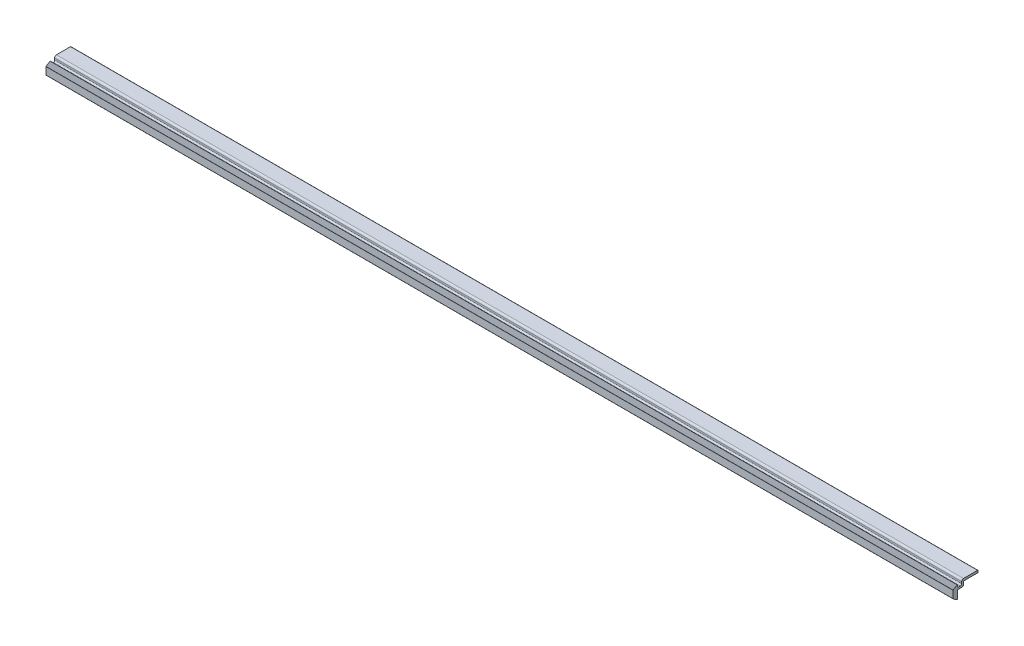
ISO-10303-21;
HEADER;
FILE_DESCRIPTION(('STEP AP214'),'2;1');
FILE_NAME('part.step','',(''),(''),'','','');
FILE_SCHEMA(('AUTOMOTIVE_DESIGN { 1 0 10303 214 1 1 1 1 }'));
ENDSEC;
DATA;
#1=APPLICATION_CONTEXT('core data for automotive mechanical design processes');
#2=APPLICATION_PROTOCOL_DEFINITION('international standard','automotive_design',2000,#1);
#3=PRODUCT_CONTEXT('',#1,'mechanical');
#4=PRODUCT('Part','Part','',(#3));
#5=PRODUCT_RELATED_PRODUCT_CATEGORY('part','',(#4));
#6=PRODUCT_DEFINITION_FORMATION('','',#4);
#7=PRODUCT_DEFINITION_CONTEXT('part definition',#1,'design');
#8=PRODUCT_DEFINITION('design','',#6,#7);
#9=PRODUCT_DEFINITION_SHAPE('','',#8);
#10=(LENGTH_UNIT() NAMED_UNIT(*) SI_UNIT(.MILLI.,.METRE.));
#11=(NAMED_UNIT(*) PLANE_ANGLE_UNIT() SI_UNIT($,.RADIAN.));
#12=(NAMED_UNIT(*) SI_UNIT($,.STERADIAN.) SOLID_ANGLE_UNIT());
#13=UNCERTAINTY_MEASURE_WITH_UNIT(LENGTH_MEASURE(1.E-05),#10,'distance_accuracy_value','');
#14=(GEOMETRIC_REPRESENTATION_CONTEXT(3) GLOBAL_UNCERTAINTY_ASSIGNED_CONTEXT((#13)) GLOBAL_UNIT_ASSIGNED_CONTEXT((#10,
#11,#12)) REPRESENTATION_CONTEXT('',''));
#15=CARTESIAN_POINT('',(0.,0.,0.));
#16=DIRECTION('',(0.,0.,1.));
#17=DIRECTION('',(1.,0.,0.));
#18=AXIS2_PLACEMENT_3D('',#15,#16,#17);
#19=CARTESIAN_POINT('',(1000.,6.60000000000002,0.30000000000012));
#20=DIRECTION('',(-1.,0.,0.));
#21=DIRECTION('',(0.,0.,1.));
#22=AXIS2_PLACEMENT_3D('',#19,#20,#21);
#23=CYLINDRICAL_SURFACE('',#22,0.300000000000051);
#24=CARTESIAN_POINT('',(0.,6.60000000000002,0.30000000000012));
#25=DIRECTION('',(1.,0.,0.));
#26=DIRECTION('',(0.,0.,-1.));
#27=AXIS2_PLACEMENT_3D('',#24,#25,#26);
#28=CIRCLE('',#27,0.300000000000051);
#29=CARTESIAN_POINT('',(0.,6.60000000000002,0.));
#30=VERTEX_POINT('',#29);
#31=CARTESIAN_POINT('',(0.,6.87967461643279,0.408545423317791));
#32=VERTEX_POINT('',#31);
#33=EDGE_CURVE('E493',#30,#32,#28,.T.);
#34=ORIENTED_EDGE('',*,*,#33,.T.);
#35=DIRECTION('',(-1.,0.,0.));
#36=VECTOR('',#35,1.);
#37=CARTESIAN_POINT('',(1000.,6.87967461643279,0.408545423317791));
#38=LINE('',#37,#36);
#39=CARTESIAN_POINT('',(1000.,6.87967461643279,0.408545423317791));
#40=VERTEX_POINT('',#39);
#41=EDGE_CURVE('E13',#40,#32,#38,.T.);
#42=ORIENTED_EDGE('',*,*,#41,.F.);
#43=CARTESIAN_POINT('',(1000.,6.60000000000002,0.30000000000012));
#44=DIRECTION('',(1.,0.,0.));
#45=DIRECTION('',(0.,0.,-1.));
#46=AXIS2_PLACEMENT_3D('',#43,#44,#45);
#47=CIRCLE('',#46,0.300000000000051);
#48=CARTESIAN_POINT('',(1000.,6.60000000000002,0.));
#49=VERTEX_POINT('',#48);
#50=EDGE_CURVE('E622',#49,#40,#47,.T.);
#51=ORIENTED_EDGE('',*,*,#50,.F.);
#52=DIRECTION('',(-1.,0.,0.));
#53=VECTOR('',#52,1.);
#54=CARTESIAN_POINT('',(1000.,6.60000000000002,0.));
#55=LINE('',#54,#53);
#56=EDGE_CURVE('E489',#49,#30,#55,.T.);
#57=ORIENTED_EDGE('',*,*,#56,.T.);
#58=EDGE_LOOP('',(#34,#42,#51,#57));
#59=FACE_BOUND('',#58,.T.);
#60=ADVANCED_FACE('F174',(#59),#23,.T.);
#61=CARTESIAN_POINT('',(1000.,6.87967461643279,0.408545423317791));
#62=DIRECTION('',(0.,-0.926768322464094,-0.375633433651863));
#63=DIRECTION('',(0.,0.375633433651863,-0.926768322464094));
#64=AXIS2_PLACEMENT_3D('',#61,#62,#63);
#65=PLANE('',#64);
#66=DIRECTION('',(0.,-0.375633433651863,0.926768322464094));
#67=VECTOR('',#66,1.);
#68=CARTESIAN_POINT('',(0.,6.87967461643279,0.408545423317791));
#69=LINE('',#68,#67);
#70=CARTESIAN_POINT('',(0.,6.70102629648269,0.849309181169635));
#71=VERTEX_POINT('',#70);
#72=EDGE_CURVE('E497',#32,#71,#69,.T.);
#73=ORIENTED_EDGE('',*,*,#72,.T.);
#74=DIRECTION('',(-1.,0.,0.));
#75=VECTOR('',#74,1.);
#76=CARTESIAN_POINT('',(1000.,6.70102629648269,0.849309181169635));
#77=LINE('',#76,#75);
#78=CARTESIAN_POINT('',(1000.,6.70102629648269,0.849309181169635));
#79=VERTEX_POINT('',#78);
#80=EDGE_CURVE('E183',#79,#71,#77,.T.);
#81=ORIENTED_EDGE('',*,*,#80,.F.);
#82=DIRECTION('',(0.,-0.375633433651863,0.926768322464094));
#83=VECTOR('',#82,1.);
#84=CARTESIAN_POINT('',(1000.,6.87967461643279,0.408545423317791));
#85=LINE('',#84,#83);
#86=EDGE_CURVE('E342',#40,#79,#85,.T.);
#87=ORIENTED_EDGE('',*,*,#86,.F.);
#88=ORIENTED_EDGE('',*,*,#41,.T.);
#89=EDGE_LOOP('',(#73,#81,#87,#88));
#90=FACE_BOUND('',#89,.T.);
#91=ADVANCED_FACE('F923',(#90),#65,.F.);
#92=CARTESIAN_POINT('',(1000.,6.70102629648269,0.849309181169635));
#93=DIRECTION('',(0.,-0.915194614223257,-0.403012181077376));
#94=DIRECTION('',(0.,0.403012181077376,-0.915194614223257));
#95=AXIS2_PLACEMENT_3D('',#92,#93,#94);
#96=PLANE('',#95);
#97=DIRECTION('',(0.,-0.403012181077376,0.915194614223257));
#98=VECTOR('',#97,1.);
#99=CARTESIAN_POINT('',(0.,6.70102629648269,0.849309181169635));
#100=LINE('',#99,#98);
#101=CARTESIAN_POINT('',(0.,6.50935685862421,1.28456857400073));
#102=VERTEX_POINT('',#101);
#103=EDGE_CURVE('E500',#71,#102,#100,.T.);
#104=ORIENTED_EDGE('',*,*,#103,.T.);
#105=DIRECTION('',(-1.,0.,0.));
#106=VECTOR('',#105,1.);
#107=CARTESIAN_POINT('',(1000.,6.50935685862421,1.28456857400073));
#108=LINE('',#107,#106);
#109=CARTESIAN_POINT('',(1000.,6.50935685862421,1.28456857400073));
#110=VERTEX_POINT('',#109);
#111=EDGE_CURVE('E776',#110,#102,#108,.T.);
#112=ORIENTED_EDGE('',*,*,#111,.F.);
#113=DIRECTION('',(0.,-0.403012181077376,0.915194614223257));
#114=VECTOR('',#113,1.);
#115=CARTESIAN_POINT('',(1000.,6.70102629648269,0.849309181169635));
#116=LINE('',#115,#114);
#117=EDGE_CURVE('E786',#79,#110,#116,.T.);
#118=ORIENTED_EDGE('',*,*,#117,.F.);
#119=ORIENTED_EDGE('',*,*,#80,.T.);
#120=EDGE_LOOP('',(#104,#112,#118,#119));
#121=FACE_BOUND('',#120,.T.);
#122=ADVANCED_FACE('F784',(#121),#96,.F.);
#123=CARTESIAN_POINT('',(1000.,6.50935685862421,1.28456857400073));
#124=DIRECTION('',(0.,-0.902812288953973,-0.430034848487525));
#125=DIRECTION('',(0.,0.430034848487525,-0.902812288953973));
#126=AXIS2_PLACEMENT_3D('',#123,#124,#125);
#127=PLANE('',#126);
#128=DIRECTION('',(0.,-0.430034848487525,0.902812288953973));
#129=VECTOR('',#128,1.);
#130=CARTESIAN_POINT('',(0.,6.50935685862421,1.28456857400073));
#131=LINE('',#130,#129);
#132=CARTESIAN_POINT('',(0.,6.30483565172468,1.71393902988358));
#133=VERTEX_POINT('',#132);
#134=EDGE_CURVE('E503',#102,#133,#131,.T.);
#135=ORIENTED_EDGE('',*,*,#134,.T.);
#136=DIRECTION('',(-1.,0.,0.));
#137=VECTOR('',#136,1.);
#138=CARTESIAN_POINT('',(1000.,6.30483565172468,1.71393902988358));
#139=LINE('',#138,#137);
#140=CARTESIAN_POINT('',(1000.,6.30483565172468,1.71393902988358));
#141=VERTEX_POINT('',#140);
#142=EDGE_CURVE('E772',#141,#133,#139,.T.);
#143=ORIENTED_EDGE('',*,*,#142,.F.);
#144=DIRECTION('',(0.,-0.430034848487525,0.902812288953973));
#145=VECTOR('',#144,1.);
#146=CARTESIAN_POINT('',(1000.,6.50935685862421,1.28456857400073));
#147=LINE('',#146,#145);
#148=EDGE_CURVE('E805',#110,#141,#147,.T.);
#149=ORIENTED_EDGE('',*,*,#148,.F.);
#150=ORIENTED_EDGE('',*,*,#111,.T.);
#151=EDGE_LOOP('',(#135,#143,#149,#150));
#152=FACE_BOUND('',#151,.T.);
#153=ADVANCED_FACE('F795',(#152),#127,.F.);
#154=CARTESIAN_POINT('',(1000.,6.30483565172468,1.71393902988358));
#155=DIRECTION('',(0.,-0.889632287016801,-0.456677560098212));
#156=DIRECTION('',(0.,0.456677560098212,-0.889632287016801));
#157=AXIS2_PLACEMENT_3D('',#154,#155,#156);
#158=PLANE('',#157);
#159=DIRECTION('',(0.,-0.456677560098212,0.889632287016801));
#160=VECTOR('',#159,1.);
#161=CARTESIAN_POINT('',(0.,6.30483565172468,1.71393902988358));
#162=LINE('',#161,#160);
#163=CARTESIAN_POINT('',(0.,6.08764337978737,2.13704118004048));
#164=VERTEX_POINT('',#163);
#165=EDGE_CURVE('E506',#133,#164,#162,.T.);
#166=ORIENTED_EDGE('',*,*,#165,.T.);
#167=DIRECTION('',(-1.,0.,0.));
#168=VECTOR('',#167,1.);
#169=CARTESIAN_POINT('',(1000.,6.08764337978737,2.13704118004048));
#170=LINE('',#169,#168);
#171=CARTESIAN_POINT('',(1000.,6.08764337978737,2.13704118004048));
#172=VERTEX_POINT('',#171);
#173=EDGE_CURVE('E768',#172,#164,#170,.T.);
#174=ORIENTED_EDGE('',*,*,#173,.F.);
#175=DIRECTION('',(0.,-0.456677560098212,0.889632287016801));
#176=VECTOR('',#175,1.);
#177=CARTESIAN_POINT('',(1000.,6.30483565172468,1.71393902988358));
#178=LINE('',#177,#176);
#179=EDGE_CURVE('E801',#141,#172,#178,.T.);
#180=ORIENTED_EDGE('',*,*,#179,.F.);
#181=ORIENTED_EDGE('',*,*,#142,.T.);
#182=EDGE_LOOP('',(#166,#174,#180,#181));
#183=FACE_BOUND('',#182,.T.);
#184=ADVANCED_FACE('F799',(#183),#158,.F.);
#185=CARTESIAN_POINT('',(1000.,6.08764337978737,2.13704118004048));
#186=DIRECTION('',(0.,-0.875666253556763,-0.482916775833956));
#187=DIRECTION('',(0.,0.482916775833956,-0.875666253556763));
#188=AXIS2_PLACEMENT_3D('',#185,#186,#187);
#189=PLANE('',#188);
#190=DIRECTION('',(0.,-0.482916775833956,0.875666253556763));
#191=VECTOR('',#190,1.);
#192=CARTESIAN_POINT('',(0.,6.08764337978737,2.13704118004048));
#193=LINE('',#192,#191);
#194=CARTESIAN_POINT('',(0.,5.85797194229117,2.55350119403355));
#195=VERTEX_POINT('',#194);
#196=EDGE_CURVE('E509',#164,#195,#193,.T.);
#197=ORIENTED_EDGE('',*,*,#196,.T.);
#198=DIRECTION('',(-1.,0.,0.));
#199=VECTOR('',#198,1.);
#200=CARTESIAN_POINT('',(1000.,5.85797194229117,2.55350119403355));
#201=LINE('',#200,#199);
#202=CARTESIAN_POINT('',(1000.,5.85797194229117,2.55350119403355));
#203=VERTEX_POINT('',#202);
#204=EDGE_CURVE('E764',#203,#195,#201,.T.);
#205=ORIENTED_EDGE('',*,*,#204,.F.);
#206=DIRECTION('',(0.,-0.482916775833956,0.875666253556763));
#207=VECTOR('',#206,1.);
#208=CARTESIAN_POINT('',(1000.,6.08764337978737,2.13704118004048));
#209=LINE('',#208,#207);
#210=EDGE_CURVE('E804',#172,#203,#209,.T.);
#211=ORIENTED_EDGE('',*,*,#210,.F.);
#212=ORIENTED_EDGE('',*,*,#173,.T.);
#213=EDGE_LOOP('',(#197,#205,#211,#212));
#214=FACE_BOUND('',#213,.T.);
#215=ADVANCED_FACE('F935',(#214),#189,.F.);
#216=CARTESIAN_POINT('',(1000.,5.85797194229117,2.55350119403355));
#217=DIRECTION('',(0.,-0.860926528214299,-0.508729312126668));
#218=DIRECTION('',(0.,0.508729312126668,-0.860926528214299));
#219=AXIS2_PLACEMENT_3D('',#216,#217,#218);
#220=PLANE('',#219);
#221=DIRECTION('',(0.,-0.508729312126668,0.860926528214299));
#222=VECTOR('',#221,1.);
#223=CARTESIAN_POINT('',(0.,5.85797194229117,2.55350119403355));
#224=LINE('',#223,#222);
#225=CARTESIAN_POINT('',(0.,5.6160242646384,2.96295111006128));
#226=VERTEX_POINT('',#225);
#227=EDGE_CURVE('E512',#195,#226,#224,.T.);
#228=ORIENTED_EDGE('',*,*,#227,.T.);
#229=DIRECTION('',(-1.,0.,0.));
#230=VECTOR('',#229,1.);
#231=CARTESIAN_POINT('',(1000.,5.6160242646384,2.96295111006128));
#232=LINE('',#231,#230);
#233=CARTESIAN_POINT('',(1000.,5.6160242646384,2.96295111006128));
#234=VERTEX_POINT('',#233);
#235=EDGE_CURVE('E760',#234,#226,#232,.T.);
#236=ORIENTED_EDGE('',*,*,#235,.F.);
#237=DIRECTION('',(0.,-0.508729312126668,0.860926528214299));
#238=VECTOR('',#237,1.);
#239=CARTESIAN_POINT('',(1000.,5.85797194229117,2.55350119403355));
#240=LINE('',#239,#238);
#241=EDGE_CURVE('E808',#203,#234,#240,.T.);
#242=ORIENTED_EDGE('',*,*,#241,.F.);
#243=ORIENTED_EDGE('',*,*,#204,.T.);
#244=EDGE_LOOP('',(#228,#236,#242,#243));
#245=FACE_BOUND('',#244,.T.);
#246=ADVANCED_FACE('F938',(#245),#220,.F.);
#247=CARTESIAN_POINT('',(1000.,5.6160242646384,2.96295111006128));
#248=DIRECTION('',(0.,-0.845426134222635,-0.5340923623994));
#249=DIRECTION('',(0.,0.5340923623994,-0.845426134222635));
#250=AXIS2_PLACEMENT_3D('',#247,#248,#249);
#251=PLANE('',#250);
#252=DIRECTION('',(0.,-0.5340923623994,0.845426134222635));
#253=VECTOR('',#252,1.);
#254=CARTESIAN_POINT('',(0.,5.6160242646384,2.96295111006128));
#255=LINE('',#254,#253);
#256=CARTESIAN_POINT('',(0.,5.36201411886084,3.36502916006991));
#257=VERTEX_POINT('',#256);
#258=EDGE_CURVE('E515',#226,#257,#255,.T.);
#259=ORIENTED_EDGE('',*,*,#258,.T.);
#260=DIRECTION('',(-1.,0.,0.));
#261=VECTOR('',#260,1.);
#262=CARTESIAN_POINT('',(1000.,5.36201411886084,3.36502916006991));
#263=LINE('',#262,#261);
#264=CARTESIAN_POINT('',(1000.,5.36201411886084,3.36502916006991));
#265=VERTEX_POINT('',#264);
#266=EDGE_CURVE('E756',#265,#257,#263,.T.);
#267=ORIENTED_EDGE('',*,*,#266,.F.);
#268=DIRECTION('',(0.,-0.5340923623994,0.845426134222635));
#269=VECTOR('',#268,1.);
#270=CARTESIAN_POINT('',(1000.,5.6160242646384,2.96295111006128));
#271=LINE('',#270,#269);
#272=EDGE_CURVE('E816',#234,#265,#271,.T.);
#273=ORIENTED_EDGE('',*,*,#272,.F.);
#274=ORIENTED_EDGE('',*,*,#235,.T.);
#275=EDGE_LOOP('',(#259,#267,#273,#274));
#276=FACE_BOUND('',#275,.T.);
#277=ADVANCED_FACE('F942',(#276),#251,.F.);
#278=CARTESIAN_POINT('',(1000.,5.36201411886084,3.36502916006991));
#279=DIRECTION('',(0.,-0.829178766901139,-0.558983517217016));
#280=DIRECTION('',(0.,0.558983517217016,-0.829178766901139));
#281=AXIS2_PLACEMENT_3D('',#278,#279,#280);
#282=PLANE('',#281);
#283=DIRECTION('',(0.,-0.558983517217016,0.829178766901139));
#284=VECTOR('',#283,1.);
#285=CARTESIAN_POINT('',(0.,5.36201411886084,3.36502916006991));
#286=LINE('',#285,#284);
#287=CARTESIAN_POINT('',(0.,5.09616593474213,3.75938008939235));
#288=VERTEX_POINT('',#287);
#289=EDGE_CURVE('E518',#257,#288,#286,.T.);
#290=ORIENTED_EDGE('',*,*,#289,.T.);
#291=DIRECTION('',(-1.,0.,0.));
#292=VECTOR('',#291,1.);
#293=CARTESIAN_POINT('',(1000.,5.09616593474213,3.75938008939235));
#294=LINE('',#293,#292);
#295=CARTESIAN_POINT('',(1000.,5.09616593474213,3.75938008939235));
#296=VERTEX_POINT('',#295);
#297=EDGE_CURVE('E752',#296,#288,#294,.T.);
#298=ORIENTED_EDGE('',*,*,#297,.F.);
#299=DIRECTION('',(0.,-0.558983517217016,0.829178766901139));
#300=VECTOR('',#299,1.);
#301=CARTESIAN_POINT('',(1000.,5.36201411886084,3.36502916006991));
#302=LINE('',#301,#300);
#303=EDGE_CURVE('E819',#265,#296,#302,.T.);
#304=ORIENTED_EDGE('',*,*,#303,.F.);
#305=ORIENTED_EDGE('',*,*,#266,.T.);
#306=EDGE_LOOP('',(#290,#298,#304,#305));
#307=FACE_BOUND('',#306,.T.);
#308=ADVANCED_FACE('F946',(#307),#282,.F.);
#309=CARTESIAN_POINT('',(1000.,5.09616593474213,3.75938008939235));
#310=DIRECTION('',(0.,-0.812198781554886,-0.583380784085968));
#311=DIRECTION('',(0.,0.583380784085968,-0.812198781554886));
#312=AXIS2_PLACEMENT_3D('',#309,#310,#311);
#313=PLANE('',#312);
#314=DIRECTION('',(0.,-0.583380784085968,0.812198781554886));
#315=VECTOR('',#314,1.);
#316=CARTESIAN_POINT('',(0.,5.09616593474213,3.75938008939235));
#317=LINE('',#316,#315);
#318=CARTESIAN_POINT('',(0.,4.81871460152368,4.14565547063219));
#319=VERTEX_POINT('',#318);
#320=EDGE_CURVE('E521',#288,#319,#317,.T.);
#321=ORIENTED_EDGE('',*,*,#320,.T.);
#322=DIRECTION('',(-1.,0.,0.));
#323=VECTOR('',#322,1.);
#324=CARTESIAN_POINT('',(1000.,4.81871460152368,4.14565547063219));
#325=LINE('',#324,#323);
#326=CARTESIAN_POINT('',(1000.,4.81871460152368,4.14565547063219));
#327=VERTEX_POINT('',#326);
#328=EDGE_CURVE('E748',#327,#319,#325,.T.);
#329=ORIENTED_EDGE('',*,*,#328,.F.);
#330=DIRECTION('',(0.,-0.583380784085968,0.812198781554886));
#331=VECTOR('',#330,1.);
#332=CARTESIAN_POINT('',(1000.,5.09616593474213,3.75938008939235));
#333=LINE('',#332,#331);
#334=EDGE_CURVE('E822',#296,#327,#333,.T.);
#335=ORIENTED_EDGE('',*,*,#334,.F.);
#336=ORIENTED_EDGE('',*,*,#297,.T.);
#337=EDGE_LOOP('',(#321,#329,#335,#336));
#338=FACE_BOUND('',#337,.T.);
#339=ADVANCED_FACE('F950',(#338),#313,.F.);
#340=CARTESIAN_POINT('',(1000.,4.81871460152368,4.14565547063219));
#341=DIRECTION('',(0.,-0.794501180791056,-0.607262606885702));
#342=DIRECTION('',(0.,0.607262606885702,-0.794501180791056));
#343=AXIS2_PLACEMENT_3D('',#340,#341,#342);
#344=PLANE('',#343);
#345=DIRECTION('',(0.,-0.607262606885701,0.794501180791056));
#346=VECTOR('',#345,1.);
#347=CARTESIAN_POINT('',(0.,4.81871460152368,4.14565547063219));
#348=LINE('',#347,#346);
#349=CARTESIAN_POINT('',(0.,4.52990526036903,4.52351401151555));
#350=VERTEX_POINT('',#349);
#351=EDGE_CURVE('E523',#319,#350,#348,.T.);
#352=ORIENTED_EDGE('',*,*,#351,.T.);
#353=DIRECTION('',(-1.,0.,0.));
#354=VECTOR('',#353,1.);
#355=CARTESIAN_POINT('',(1000.,4.52990526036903,4.52351401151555));
#356=LINE('',#355,#354);
#357=CARTESIAN_POINT('',(1000.,4.52990526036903,4.52351401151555));
#358=VERTEX_POINT('',#357);
#359=EDGE_CURVE('E744',#358,#350,#356,.T.);
#360=ORIENTED_EDGE('',*,*,#359,.F.);
#361=DIRECTION('',(0.,-0.607262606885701,0.794501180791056));
#362=VECTOR('',#361,1.);
#363=CARTESIAN_POINT('',(1000.,4.81871460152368,4.14565547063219));
#364=LINE('',#363,#362);
#365=EDGE_CURVE('E825',#327,#358,#364,.T.);
#366=ORIENTED_EDGE('',*,*,#365,.F.);
#367=ORIENTED_EDGE('',*,*,#328,.T.);
#368=EDGE_LOOP('',(#352,#360,#366,#367));
#369=FACE_BOUND('',#368,.T.);
#370=ADVANCED_FACE('F954',(#369),#344,.F.);
#371=CARTESIAN_POINT('',(1000.,4.52990526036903,4.52351401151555));
#372=DIRECTION('',(0.,-0.776101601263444,-0.630607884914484));
#373=DIRECTION('',(0.,0.630607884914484,-0.776101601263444));
#374=AXIS2_PLACEMENT_3D('',#371,#372,#373);
#375=PLANE('',#374);
#376=DIRECTION('',(0.,-0.630607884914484,0.776101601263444));
#377=VECTOR('',#376,1.);
#378=CARTESIAN_POINT('',(0.,4.52990526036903,4.52351401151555));
#379=LINE('',#378,#377);
#380=CARTESIAN_POINT('',(0.,4.22999308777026,4.89262185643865));
#381=VERTEX_POINT('',#380);
#382=EDGE_CURVE('E526',#350,#381,#379,.T.);
#383=ORIENTED_EDGE('',*,*,#382,.T.);
#384=DIRECTION('',(-1.,0.,0.));
#385=VECTOR('',#384,1.);
#386=CARTESIAN_POINT('',(1000.,4.22999308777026,4.89262185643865));
#387=LINE('',#386,#385);
#388=CARTESIAN_POINT('',(1000.,4.22999308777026,4.89262185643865));
#389=VERTEX_POINT('',#388);
#390=EDGE_CURVE('E740',#389,#381,#387,.T.);
#391=ORIENTED_EDGE('',*,*,#390,.F.);
#392=DIRECTION('',(0.,-0.630607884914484,0.776101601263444));
#393=VECTOR('',#392,1.);
#394=CARTESIAN_POINT('',(1000.,4.52990526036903,4.52351401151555));
#395=LINE('',#394,#393);
#396=EDGE_CURVE('E828',#358,#389,#395,.T.);
#397=ORIENTED_EDGE('',*,*,#396,.F.);
#398=ORIENTED_EDGE('',*,*,#359,.T.);
#399=EDGE_LOOP('',(#383,#391,#397,#398));
#400=FACE_BOUND('',#399,.T.);
#401=ADVANCED_FACE('F958',(#400),#375,.F.);
#402=CARTESIAN_POINT('',(1000.,3.99999999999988,4.7));
#403=DIRECTION('',(-1.,0.,0.));
#404=DIRECTION('',(0.,0.,1.));
#405=AXIS2_PLACEMENT_3D('',#402,#403,#404);
#406=CYLINDRICAL_SURFACE('',#405,0.300000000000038);
#407=CARTESIAN_POINT('',(0.,3.99999999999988,4.7));
#408=DIRECTION('',(1.,0.,0.));
#409=DIRECTION('',(0.,0.,-1.));
#410=AXIS2_PLACEMENT_3D('',#407,#408,#409);
#411=CIRCLE('',#410,0.300000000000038);
#412=CARTESIAN_POINT('',(0.,3.99999999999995,5.00000000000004));
#413=VERTEX_POINT('',#412);
#414=EDGE_CURVE('E529',#381,#413,#411,.T.);
#415=ORIENTED_EDGE('',*,*,#414,.T.);
#416=DIRECTION('',(-1.,0.,0.));
#417=VECTOR('',#416,1.);
#418=CARTESIAN_POINT('',(1000.,3.99999999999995,5.00000000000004));
#419=LINE('',#418,#417);
#420=CARTESIAN_POINT('',(1000.,3.99999999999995,5.00000000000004));
#421=VERTEX_POINT('',#420);
#422=EDGE_CURVE('E736',#421,#413,#419,.T.);
#423=ORIENTED_EDGE('',*,*,#422,.F.);
#424=CARTESIAN_POINT('',(1000.,3.99999999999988,4.7));
#425=DIRECTION('',(1.,0.,0.));
#426=DIRECTION('',(0.,0.,-1.));
#427=AXIS2_PLACEMENT_3D('',#424,#425,#426);
#428=CIRCLE('',#427,0.300000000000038);
#429=EDGE_CURVE('E831',#389,#421,#428,.T.);
#430=ORIENTED_EDGE('',*,*,#429,.F.);
#431=ORIENTED_EDGE('',*,*,#390,.T.);
#432=EDGE_LOOP('',(#415,#423,#430,#431));
#433=FACE_BOUND('',#432,.T.);
#434=ADVANCED_FACE('F962',(#433),#406,.T.);
#435=CARTESIAN_POINT('',(1000.,3.99999999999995,5.00000000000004));
#436=DIRECTION('',(0.,0.,-1.));
#437=DIRECTION('',(0.,1.,0.));
#438=AXIS2_PLACEMENT_3D('',#435,#436,#437);
#439=PLANE('',#438);
#440=DIRECTION('',(0.,-1.,0.));
#441=VECTOR('',#440,1.);
#442=CARTESIAN_POINT('',(0.,3.99999999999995,5.00000000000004));
#443=LINE('',#442,#441);
#444=CARTESIAN_POINT('',(0.,-4.00000000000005,4.99999999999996));
#445=VERTEX_POINT('',#444);
#446=EDGE_CURVE('E532',#413,#445,#443,.T.);
#447=ORIENTED_EDGE('',*,*,#446,.T.);
#448=DIRECTION('',(-1.,0.,0.));
#449=VECTOR('',#448,1.);
#450=CARTESIAN_POINT('',(1000.,-4.00000000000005,4.99999999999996));
#451=LINE('',#450,#449);
#452=CARTESIAN_POINT('',(1000.,-4.00000000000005,4.99999999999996));
#453=VERTEX_POINT('',#452);
#454=EDGE_CURVE('E732',#453,#445,#451,.T.);
#455=ORIENTED_EDGE('',*,*,#454,.F.);
#456=DIRECTION('',(0.,-1.,0.));
#457=VECTOR('',#456,1.);
#458=CARTESIAN_POINT('',(1000.,3.99999999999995,5.00000000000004));
#459=LINE('',#458,#457);
#460=EDGE_CURVE('E834',#421,#453,#459,.T.);
#461=ORIENTED_EDGE('',*,*,#460,.F.);
#462=ORIENTED_EDGE('',*,*,#422,.T.);
#463=EDGE_LOOP('',(#447,#455,#461,#462));
#464=FACE_BOUND('',#463,.T.);
#465=ADVANCED_FACE('F966',(#464),#439,.F.);
#466=CARTESIAN_POINT('',(1000.,-4.00000000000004,4.69999999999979));
#467=DIRECTION('',(-1.,0.,0.));
#468=DIRECTION('',(0.,0.,1.));
#469=AXIS2_PLACEMENT_3D('',#466,#467,#468);
#470=CYLINDRICAL_SURFACE('',#469,0.300000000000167);
#471=CARTESIAN_POINT('',(0.,-4.00000000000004,4.69999999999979));
#472=DIRECTION('',(1.,0.,0.));
#473=DIRECTION('',(0.,0.,-1.));
#474=AXIS2_PLACEMENT_3D('',#471,#472,#473);
#475=CIRCLE('',#474,0.300000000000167);
#476=CARTESIAN_POINT('',(0.,-4.22999308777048,4.89262185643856));
#477=VERTEX_POINT('',#476);
#478=EDGE_CURVE('E535',#445,#477,#475,.T.);
#479=ORIENTED_EDGE('',*,*,#478,.T.);
#480=DIRECTION('',(-1.,0.,0.));
#481=VECTOR('',#480,1.);
#482=CARTESIAN_POINT('',(1000.,-4.22999308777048,4.89262185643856));
#483=LINE('',#482,#481);
#484=CARTESIAN_POINT('',(1000.,-4.22999308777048,4.89262185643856));
#485=VERTEX_POINT('',#484);
#486=EDGE_CURVE('E728',#485,#477,#483,.T.);
#487=ORIENTED_EDGE('',*,*,#486,.F.);
#488=CARTESIAN_POINT('',(1000.,-4.00000000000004,4.69999999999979));
#489=DIRECTION('',(1.,0.,0.));
#490=DIRECTION('',(0.,0.,-1.));
#491=AXIS2_PLACEMENT_3D('',#488,#489,#490);
#492=CIRCLE('',#491,0.300000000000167);
#493=EDGE_CURVE('E837',#453,#485,#492,.T.);
#494=ORIENTED_EDGE('',*,*,#493,.F.);
#495=ORIENTED_EDGE('',*,*,#454,.T.);
#496=EDGE_LOOP('',(#479,#487,#494,#495));
#497=FACE_BOUND('',#496,.T.);
#498=ADVANCED_FACE('F970',(#497),#470,.T.);
#499=CARTESIAN_POINT('',(1000.,-4.22999308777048,4.89262185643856));
#500=DIRECTION('',(0.,0.776101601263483,-0.630607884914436));
#501=DIRECTION('',(0.,0.630607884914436,0.776101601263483));
#502=AXIS2_PLACEMENT_3D('',#499,#500,#501);
#503=PLANE('',#502);
#504=DIRECTION('',(0.,-0.630607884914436,-0.776101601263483));
#505=VECTOR('',#504,1.);
#506=CARTESIAN_POINT('',(0.,-4.22999308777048,4.89262185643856));
#507=LINE('',#506,#505);
#508=CARTESIAN_POINT('',(0.,-4.52990526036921,4.52351401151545));
#509=VERTEX_POINT('',#508);
#510=EDGE_CURVE('E538',#477,#509,#507,.T.);
#511=ORIENTED_EDGE('',*,*,#510,.T.);
#512=DIRECTION('',(-1.,0.,0.));
#513=VECTOR('',#512,1.);
#514=CARTESIAN_POINT('',(1000.,-4.52990526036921,4.52351401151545));
#515=LINE('',#514,#513);
#516=CARTESIAN_POINT('',(1000.,-4.52990526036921,4.52351401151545));
#517=VERTEX_POINT('',#516);
#518=EDGE_CURVE('E724',#517,#509,#515,.T.);
#519=ORIENTED_EDGE('',*,*,#518,.F.);
#520=DIRECTION('',(0.,-0.630607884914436,-0.776101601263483));
#521=VECTOR('',#520,1.);
#522=CARTESIAN_POINT('',(1000.,-4.22999308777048,4.89262185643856));
#523=LINE('',#522,#521);
#524=EDGE_CURVE('E840',#485,#517,#523,.T.);
#525=ORIENTED_EDGE('',*,*,#524,.F.);
#526=ORIENTED_EDGE('',*,*,#486,.T.);
#527=EDGE_LOOP('',(#511,#519,#525,#526));
#528=FACE_BOUND('',#527,.T.);
#529=ADVANCED_FACE('F974',(#528),#503,.F.);
#530=CARTESIAN_POINT('',(1000.,-4.52990526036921,4.52351401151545));
#531=DIRECTION('',(0.,0.79450118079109,-0.607262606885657));
#532=DIRECTION('',(0.,0.607262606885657,0.79450118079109));
#533=AXIS2_PLACEMENT_3D('',#530,#531,#532);
#534=PLANE('',#533);
#535=DIRECTION('',(0.,-0.607262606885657,-0.79450118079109));
#536=VECTOR('',#535,1.);
#537=CARTESIAN_POINT('',(0.,-4.52990526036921,4.52351401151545));
#538=LINE('',#537,#536);
#539=CARTESIAN_POINT('',(0.,-4.81871460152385,4.14565547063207));
#540=VERTEX_POINT('',#539);
#541=EDGE_CURVE('E541',#509,#540,#538,.T.);
#542=ORIENTED_EDGE('',*,*,#541,.T.);
#543=DIRECTION('',(-1.,0.,0.));
#544=VECTOR('',#543,1.);
#545=CARTESIAN_POINT('',(1000.,-4.81871460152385,4.14565547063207));
#546=LINE('',#545,#544);
#547=CARTESIAN_POINT('',(1000.,-4.81871460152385,4.14565547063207));
#548=VERTEX_POINT('',#547);
#549=EDGE_CURVE('E720',#548,#540,#546,.T.);
#550=ORIENTED_EDGE('',*,*,#549,.F.);
#551=DIRECTION('',(0.,-0.607262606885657,-0.79450118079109));
#552=VECTOR('',#551,1.);
#553=CARTESIAN_POINT('',(1000.,-4.52990526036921,4.52351401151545));
#554=LINE('',#553,#552);
#555=EDGE_CURVE('E843',#517,#548,#554,.T.);
#556=ORIENTED_EDGE('',*,*,#555,.F.);
#557=ORIENTED_EDGE('',*,*,#518,.T.);
#558=EDGE_LOOP('',(#542,#550,#556,#557));
#559=FACE_BOUND('',#558,.T.);
#560=ADVANCED_FACE('F978',(#559),#534,.F.);
#561=CARTESIAN_POINT('',(1000.,-4.81871460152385,4.14565547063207));
#562=DIRECTION('',(0.,0.812198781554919,-0.583380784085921));
#563=DIRECTION('',(0.,0.583380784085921,0.812198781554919));
#564=AXIS2_PLACEMENT_3D('',#561,#562,#563);
#565=PLANE('',#564);
#566=DIRECTION('',(0.,-0.583380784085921,-0.812198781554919));
#567=VECTOR('',#566,1.);
#568=CARTESIAN_POINT('',(0.,-4.81871460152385,4.14565547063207));
#569=LINE('',#568,#567);
#570=CARTESIAN_POINT('',(0.,-5.09616593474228,3.75938008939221));
#571=VERTEX_POINT('',#570);
#572=EDGE_CURVE('E544',#540,#571,#569,.T.);
#573=ORIENTED_EDGE('',*,*,#572,.T.);
#574=DIRECTION('',(-1.,0.,0.));
#575=VECTOR('',#574,1.);
#576=CARTESIAN_POINT('',(1000.,-5.09616593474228,3.75938008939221));
#577=LINE('',#576,#575);
#578=CARTESIAN_POINT('',(1000.,-5.09616593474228,3.75938008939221));
#579=VERTEX_POINT('',#578);
#580=EDGE_CURVE('E716',#579,#571,#577,.T.);
#581=ORIENTED_EDGE('',*,*,#580,.F.);
#582=DIRECTION('',(0.,-0.583380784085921,-0.812198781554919));
#583=VECTOR('',#582,1.);
#584=CARTESIAN_POINT('',(1000.,-4.81871460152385,4.14565547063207));
#585=LINE('',#584,#583);
#586=EDGE_CURVE('E846',#548,#579,#585,.T.);
#587=ORIENTED_EDGE('',*,*,#586,.F.);
#588=ORIENTED_EDGE('',*,*,#549,.T.);
#589=EDGE_LOOP('',(#573,#581,#587,#588));
#590=FACE_BOUND('',#589,.T.);
#591=ADVANCED_FACE('F982',(#590),#565,.F.);
#592=CARTESIAN_POINT('',(1000.,-5.09616593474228,3.75938008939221));
#593=DIRECTION('',(0.,0.829178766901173,-0.558983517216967));
#594=DIRECTION('',(0.,0.558983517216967,0.829178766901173));
#595=AXIS2_PLACEMENT_3D('',#592,#593,#594);
#596=PLANE('',#595);
#597=DIRECTION('',(0.,-0.558983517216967,-0.829178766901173));
#598=VECTOR('',#597,1.);
#599=CARTESIAN_POINT('',(0.,-5.09616593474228,3.75938008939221));
#600=LINE('',#599,#598);
#601=CARTESIAN_POINT('',(0.,-5.36201411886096,3.36502916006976));
#602=VERTEX_POINT('',#601);
#603=EDGE_CURVE('E547',#571,#602,#600,.T.);
#604=ORIENTED_EDGE('',*,*,#603,.T.);
#605=DIRECTION('',(-1.,0.,0.));
#606=VECTOR('',#605,1.);
#607=CARTESIAN_POINT('',(1000.,-5.36201411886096,3.36502916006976));
#608=LINE('',#607,#606);
#609=CARTESIAN_POINT('',(1000.,-5.36201411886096,3.36502916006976));
#610=VERTEX_POINT('',#609);
#611=EDGE_CURVE('E712',#610,#602,#608,.T.);
#612=ORIENTED_EDGE('',*,*,#611,.F.);
#613=DIRECTION('',(0.,-0.558983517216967,-0.829178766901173));
#614=VECTOR('',#613,1.);
#615=CARTESIAN_POINT('',(1000.,-5.09616593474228,3.75938008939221));
#616=LINE('',#615,#614);
#617=EDGE_CURVE('E849',#579,#610,#616,.T.);
#618=ORIENTED_EDGE('',*,*,#617,.F.);
#619=ORIENTED_EDGE('',*,*,#580,.T.);
#620=EDGE_LOOP('',(#604,#612,#618,#619));
#621=FACE_BOUND('',#620,.T.);
#622=ADVANCED_FACE('F986',(#621),#596,.F.);
#623=CARTESIAN_POINT('',(1000.,-5.36201411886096,3.36502916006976));
#624=DIRECTION('',(0.,0.845426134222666,-0.53409236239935));
#625=DIRECTION('',(0.,0.53409236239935,0.845426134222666));
#626=AXIS2_PLACEMENT_3D('',#623,#624,#625);
#627=PLANE('',#626);
#628=DIRECTION('',(0.,-0.53409236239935,-0.845426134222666));
#629=VECTOR('',#628,1.);
#630=CARTESIAN_POINT('',(0.,-5.36201411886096,3.36502916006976));
#631=LINE('',#630,#629);
#632=CARTESIAN_POINT('',(0.,-5.61602426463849,2.96295111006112));
#633=VERTEX_POINT('',#632);
#634=EDGE_CURVE('E550',#602,#633,#631,.T.);
#635=ORIENTED_EDGE('',*,*,#634,.T.);
#636=DIRECTION('',(-1.,0.,0.));
#637=VECTOR('',#636,1.);
#638=CARTESIAN_POINT('',(1000.,-5.61602426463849,2.96295111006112));
#639=LINE('',#638,#637);
#640=CARTESIAN_POINT('',(1000.,-5.61602426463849,2.96295111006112));
#641=VERTEX_POINT('',#640);
#642=EDGE_CURVE('E708',#641,#633,#639,.T.);
#643=ORIENTED_EDGE('',*,*,#642,.F.);
#644=DIRECTION('',(0.,-0.53409236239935,-0.845426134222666));
#645=VECTOR('',#644,1.);
#646=CARTESIAN_POINT('',(1000.,-5.36201411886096,3.36502916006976));
#647=LINE('',#646,#645);
#648=EDGE_CURVE('E852',#610,#641,#647,.T.);
#649=ORIENTED_EDGE('',*,*,#648,.F.);
#650=ORIENTED_EDGE('',*,*,#611,.T.);
#651=EDGE_LOOP('',(#635,#643,#649,#650));
#652=FACE_BOUND('',#651,.T.);
#653=ADVANCED_FACE('F990',(#652),#627,.F.);
#654=CARTESIAN_POINT('',(1000.,-5.61602426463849,2.96295111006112));
#655=DIRECTION('',(0.,0.860926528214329,-0.508729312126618));
#656=DIRECTION('',(0.,0.508729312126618,0.860926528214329));
#657=AXIS2_PLACEMENT_3D('',#654,#655,#656);
#658=PLANE('',#657);
#659=DIRECTION('',(0.,-0.508729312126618,-0.860926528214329));
#660=VECTOR('',#659,1.);
#661=CARTESIAN_POINT('',(0.,-5.61602426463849,2.96295111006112));
#662=LINE('',#661,#660);
#663=CARTESIAN_POINT('',(0.,-5.85797194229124,2.55350119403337));
#664=VERTEX_POINT('',#663);
#665=EDGE_CURVE('E553',#633,#664,#662,.T.);
#666=ORIENTED_EDGE('',*,*,#665,.T.);
#667=DIRECTION('',(-1.,0.,0.));
#668=VECTOR('',#667,1.);
#669=CARTESIAN_POINT('',(1000.,-5.85797194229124,2.55350119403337));
#670=LINE('',#669,#668);
#671=CARTESIAN_POINT('',(1000.,-5.85797194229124,2.55350119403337));
#672=VERTEX_POINT('',#671);
#673=EDGE_CURVE('E704',#672,#664,#670,.T.);
#674=ORIENTED_EDGE('',*,*,#673,.F.);
#675=DIRECTION('',(0.,-0.508729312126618,-0.860926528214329));
#676=VECTOR('',#675,1.);
#677=CARTESIAN_POINT('',(1000.,-5.61602426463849,2.96295111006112));
#678=LINE('',#677,#676);
#679=EDGE_CURVE('E855',#641,#672,#678,.T.);
#680=ORIENTED_EDGE('',*,*,#679,.F.);
#681=ORIENTED_EDGE('',*,*,#642,.T.);
#682=EDGE_LOOP('',(#666,#674,#680,#681));
#683=FACE_BOUND('',#682,.T.);
#684=ADVANCED_FACE('F994',(#683),#658,.F.);
#685=CARTESIAN_POINT('',(1000.,-5.85797194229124,2.55350119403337));
#686=DIRECTION('',(0.,0.875666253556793,-0.482916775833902));
#687=DIRECTION('',(0.,0.482916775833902,0.875666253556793));
#688=AXIS2_PLACEMENT_3D('',#685,#686,#687);
#689=PLANE('',#688);
#690=DIRECTION('',(0.,-0.482916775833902,-0.875666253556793));
#691=VECTOR('',#690,1.);
#692=CARTESIAN_POINT('',(0.,-5.85797194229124,2.55350119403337));
#693=LINE('',#692,#691);
#694=CARTESIAN_POINT('',(0.,-6.08764337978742,2.13704118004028));
#695=VERTEX_POINT('',#694);
#696=EDGE_CURVE('E556',#664,#695,#693,.T.);
#697=ORIENTED_EDGE('',*,*,#696,.T.);
#698=DIRECTION('',(-1.,0.,0.));
#699=VECTOR('',#698,1.);
#700=CARTESIAN_POINT('',(1000.,-6.08764337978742,2.13704118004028));
#701=LINE('',#700,#699);
#702=CARTESIAN_POINT('',(1000.,-6.08764337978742,2.13704118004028));
#703=VERTEX_POINT('',#702);
#704=EDGE_CURVE('E700',#703,#695,#701,.T.);
#705=ORIENTED_EDGE('',*,*,#704,.F.);
#706=DIRECTION('',(0.,-0.482916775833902,-0.875666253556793));
#707=VECTOR('',#706,1.);
#708=CARTESIAN_POINT('',(1000.,-5.85797194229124,2.55350119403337));
#709=LINE('',#708,#707);
#710=EDGE_CURVE('E858',#672,#703,#709,.T.);
#711=ORIENTED_EDGE('',*,*,#710,.F.);
#712=ORIENTED_EDGE('',*,*,#673,.T.);
#713=EDGE_LOOP('',(#697,#705,#711,#712));
#714=FACE_BOUND('',#713,.T.);
#715=ADVANCED_FACE('F998',(#714),#689,.F.);
#716=CARTESIAN_POINT('',(1000.,-6.08764337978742,2.13704118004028));
#717=DIRECTION('',(0.,0.889632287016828,-0.456677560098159));
#718=DIRECTION('',(0.,0.456677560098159,0.889632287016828));
#719=AXIS2_PLACEMENT_3D('',#716,#717,#718);
#720=PLANE('',#719);
#721=DIRECTION('',(0.,-0.456677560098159,-0.889632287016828));
#722=VECTOR('',#721,1.);
#723=CARTESIAN_POINT('',(0.,-6.08764337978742,2.13704118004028));
#724=LINE('',#723,#722);
#725=CARTESIAN_POINT('',(0.,-6.3048356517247,1.71393902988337));
#726=VERTEX_POINT('',#725);
#727=EDGE_CURVE('E559',#695,#726,#724,.T.);
#728=ORIENTED_EDGE('',*,*,#727,.T.);
#729=DIRECTION('',(-1.,0.,0.));
#730=VECTOR('',#729,1.);
#731=CARTESIAN_POINT('',(1000.,-6.3048356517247,1.71393902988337));
#732=LINE('',#731,#730);
#733=CARTESIAN_POINT('',(1000.,-6.3048356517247,1.71393902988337));
#734=VERTEX_POINT('',#733);
#735=EDGE_CURVE('E696',#734,#726,#732,.T.);
#736=ORIENTED_EDGE('',*,*,#735,.F.);
#737=DIRECTION('',(0.,-0.456677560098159,-0.889632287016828));
#738=VECTOR('',#737,1.);
#739=CARTESIAN_POINT('',(1000.,-6.08764337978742,2.13704118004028));
#740=LINE('',#739,#738);
#741=EDGE_CURVE('E861',#703,#734,#740,.T.);
#742=ORIENTED_EDGE('',*,*,#741,.F.);
#743=ORIENTED_EDGE('',*,*,#704,.T.);
#744=EDGE_LOOP('',(#728,#736,#742,#743));
#745=FACE_BOUND('',#744,.T.);
#746=ADVANCED_FACE('F1002',(#745),#720,.F.);
#747=CARTESIAN_POINT('',(1000.,-6.3048356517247,1.71393902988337));
#748=DIRECTION('',(0.,0.902812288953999,-0.430034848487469));
#749=DIRECTION('',(0.,0.430034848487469,0.902812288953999));
#750=AXIS2_PLACEMENT_3D('',#747,#748,#749);
#751=PLANE('',#750);
#752=DIRECTION('',(0.,-0.430034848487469,-0.902812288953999));
#753=VECTOR('',#752,1.);
#754=CARTESIAN_POINT('',(0.,-6.3048356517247,1.71393902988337));
#755=LINE('',#754,#753);
#756=CARTESIAN_POINT('',(0.,-6.50935685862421,1.28456857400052));
#757=VERTEX_POINT('',#756);
#758=EDGE_CURVE('E562',#726,#757,#755,.T.);
#759=ORIENTED_EDGE('',*,*,#758,.T.);
#760=DIRECTION('',(-1.,0.,0.));
#761=VECTOR('',#760,1.);
#762=CARTESIAN_POINT('',(1000.,-6.50935685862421,1.28456857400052));
#763=LINE('',#762,#761);
#764=CARTESIAN_POINT('',(1000.,-6.50935685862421,1.28456857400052));
#765=VERTEX_POINT('',#764);
#766=EDGE_CURVE('E692',#765,#757,#763,.T.);
#767=ORIENTED_EDGE('',*,*,#766,.F.);
#768=DIRECTION('',(0.,-0.430034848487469,-0.902812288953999));
#769=VECTOR('',#768,1.);
#770=CARTESIAN_POINT('',(1000.,-6.3048356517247,1.71393902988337));
#771=LINE('',#770,#769);
#772=EDGE_CURVE('E864',#734,#765,#771,.T.);
#773=ORIENTED_EDGE('',*,*,#772,.F.);
#774=ORIENTED_EDGE('',*,*,#735,.T.);
#775=EDGE_LOOP('',(#759,#767,#773,#774));
#776=FACE_BOUND('',#775,.T.);
#777=ADVANCED_FACE('F1006',(#776),#751,.F.);
#778=CARTESIAN_POINT('',(1000.,-6.50935685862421,1.28456857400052));
#779=DIRECTION('',(0.,0.915194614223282,-0.403012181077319));
#780=DIRECTION('',(0.,0.403012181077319,0.915194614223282));
#781=AXIS2_PLACEMENT_3D('',#778,#779,#780);
#782=PLANE('',#781);
#783=DIRECTION('',(0.,-0.403012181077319,-0.915194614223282));
#784=VECTOR('',#783,1.);
#785=CARTESIAN_POINT('',(0.,-6.50935685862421,1.28456857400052));
#786=LINE('',#785,#784);
#787=CARTESIAN_POINT('',(0.,-6.70102629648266,0.849309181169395));
#788=VERTEX_POINT('',#787);
#789=EDGE_CURVE('E565',#757,#788,#786,.T.);
#790=ORIENTED_EDGE('',*,*,#789,.T.);
#791=DIRECTION('',(-1.,0.,0.));
#792=VECTOR('',#791,1.);
#793=CARTESIAN_POINT('',(1000.,-6.70102629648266,0.849309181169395));
#794=LINE('',#793,#792);
#795=CARTESIAN_POINT('',(1000.,-6.70102629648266,0.849309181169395));
#796=VERTEX_POINT('',#795);
#797=EDGE_CURVE('E688',#796,#788,#794,.T.);
#798=ORIENTED_EDGE('',*,*,#797,.F.);
#799=DIRECTION('',(0.,-0.403012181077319,-0.915194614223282));
#800=VECTOR('',#799,1.);
#801=CARTESIAN_POINT('',(1000.,-6.50935685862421,1.28456857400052));
#802=LINE('',#801,#800);
#803=EDGE_CURVE('E867',#765,#796,#802,.T.);
#804=ORIENTED_EDGE('',*,*,#803,.F.);
#805=ORIENTED_EDGE('',*,*,#766,.T.);
#806=EDGE_LOOP('',(#790,#798,#804,#805));
#807=FACE_BOUND('',#806,.T.);
#808=ADVANCED_FACE('F1010',(#807),#782,.F.);
#809=CARTESIAN_POINT('',(1000.,-6.70102629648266,0.849309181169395));
#810=DIRECTION('',(0.,0.926768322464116,-0.375633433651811));
#811=DIRECTION('',(0.,0.375633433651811,0.926768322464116));
#812=AXIS2_PLACEMENT_3D('',#809,#810,#811);
#813=PLANE('',#812);
#814=DIRECTION('',(0.,-0.375633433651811,-0.926768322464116));
#815=VECTOR('',#814,1.);
#816=CARTESIAN_POINT('',(0.,-6.70102629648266,0.849309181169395));
#817=LINE('',#816,#815);
#818=CARTESIAN_POINT('',(0.,-6.87967461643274,0.408545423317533));
#819=VERTEX_POINT('',#818);
#820=EDGE_CURVE('E568',#788,#819,#817,.T.);
#821=ORIENTED_EDGE('',*,*,#820,.T.);
#822=DIRECTION('',(-1.,0.,0.));
#823=VECTOR('',#822,1.);
#824=CARTESIAN_POINT('',(1000.,-6.87967461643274,0.408545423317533));
#825=LINE('',#824,#823);
#826=CARTESIAN_POINT('',(1000.,-6.87967461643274,0.408545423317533));
#827=VERTEX_POINT('',#826);
#828=EDGE_CURVE('E684',#827,#819,#825,.T.);
#829=ORIENTED_EDGE('',*,*,#828,.F.);
#830=DIRECTION('',(0.,-0.375633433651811,-0.926768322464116));
#831=VECTOR('',#830,1.);
#832=CARTESIAN_POINT('',(1000.,-6.70102629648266,0.849309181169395));
#833=LINE('',#832,#831);
#834=EDGE_CURVE('E870',#796,#827,#833,.T.);
#835=ORIENTED_EDGE('',*,*,#834,.F.);
#836=ORIENTED_EDGE('',*,*,#797,.T.);
#837=EDGE_LOOP('',(#821,#829,#835,#836));
#838=FACE_BOUND('',#837,.T.);
#839=ADVANCED_FACE('F1014',(#838),#813,.F.);
#840=CARTESIAN_POINT('',(1000.,-6.60000000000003,0.299999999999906));
#841=DIRECTION('',(-1.,0.,0.));
#842=DIRECTION('',(0.,0.,1.));
#843=AXIS2_PLACEMENT_3D('',#840,#841,#842);
#844=CYLINDRICAL_SURFACE('',#843,0.299999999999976);
#845=CARTESIAN_POINT('',(0.,-6.60000000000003,0.299999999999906));
#846=DIRECTION('',(1.,0.,0.));
#847=DIRECTION('',(0.,0.,-1.));
#848=AXIS2_PLACEMENT_3D('',#845,#846,#847);
#849=CIRCLE('',#848,0.299999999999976);
#850=CARTESIAN_POINT('',(0.,-6.60000000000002,0.));
#851=VERTEX_POINT('',#850);
#852=EDGE_CURVE('E571',#819,#851,#849,.T.);
#853=ORIENTED_EDGE('',*,*,#852,.T.);
#854=DIRECTION('',(-1.,0.,0.));
#855=VECTOR('',#854,1.);
#856=CARTESIAN_POINT('',(1000.,-6.60000000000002,0.));
#857=LINE('',#856,#855);
#858=CARTESIAN_POINT('',(1000.,-6.60000000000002,0.));
#859=VERTEX_POINT('',#858);
#860=EDGE_CURVE('E680',#859,#851,#857,.T.);
#861=ORIENTED_EDGE('',*,*,#860,.F.);
#862=CARTESIAN_POINT('',(1000.,-6.60000000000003,0.299999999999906));
#863=DIRECTION('',(1.,0.,0.));
#864=DIRECTION('',(0.,0.,-1.));
#865=AXIS2_PLACEMENT_3D('',#862,#863,#864);
#866=CIRCLE('',#865,0.299999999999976);
#867=EDGE_CURVE('E873',#827,#859,#866,.T.);
#868=ORIENTED_EDGE('',*,*,#867,.F.);
#869=ORIENTED_EDGE('',*,*,#828,.T.);
#870=EDGE_LOOP('',(#853,#861,#868,#869));
#871=FACE_BOUND('',#870,.T.);
#872=ADVANCED_FACE('F1018',(#871),#844,.T.);
#873=CARTESIAN_POINT('',(1000.,-6.60000000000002,0.));
#874=DIRECTION('',(0.,0.,1.));
#875=DIRECTION('',(0.,-1.,0.));
#876=AXIS2_PLACEMENT_3D('',#873,#874,#875);
#877=PLANE('',#876);
#878=DIRECTION('',(0.,1.,0.));
#879=VECTOR('',#878,1.);
#880=CARTESIAN_POINT('',(0.,-6.60000000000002,0.));
#881=LINE('',#880,#879);
#882=CARTESIAN_POINT('',(0.,1.59999999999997,0.));
#883=VERTEX_POINT('',#882);
#884=EDGE_CURVE('E574',#851,#883,#881,.T.);
#885=ORIENTED_EDGE('',*,*,#884,.T.);
#886=DIRECTION('',(-1.,0.,0.));
#887=VECTOR('',#886,1.);
#888=CARTESIAN_POINT('',(1000.,1.59999999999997,0.));
#889=LINE('',#888,#887);
#890=CARTESIAN_POINT('',(1000.,1.59999999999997,0.));
#891=VERTEX_POINT('',#890);
#892=EDGE_CURVE('E676',#891,#883,#889,.T.);
#893=ORIENTED_EDGE('',*,*,#892,.F.);
#894=DIRECTION('',(0.,1.,0.));
#895=VECTOR('',#894,1.);
#896=CARTESIAN_POINT('',(1000.,-6.60000000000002,0.));
#897=LINE('',#896,#895);
#898=EDGE_CURVE('E876',#859,#891,#897,.T.);
#899=ORIENTED_EDGE('',*,*,#898,.F.);
#900=ORIENTED_EDGE('',*,*,#860,.T.);
#901=EDGE_LOOP('',(#885,#893,#899,#900));
#902=FACE_BOUND('',#901,.T.);
#903=ADVANCED_FACE('F1022',(#902),#877,.F.);
#904=CARTESIAN_POINT('',(1000.,1.59999999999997,-0.499999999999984));
#905=DIRECTION('',(-1.,0.,0.));
#906=DIRECTION('',(0.,0.,1.));
#907=AXIS2_PLACEMENT_3D('',#904,#905,#906);
#908=CYLINDRICAL_SURFACE('',#907,0.5);
#909=CARTESIAN_POINT('',(0.,1.59999999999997,-0.499999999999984));
#910=DIRECTION('',(-1.,0.,0.));
#911=DIRECTION('',(0.,0.,-1.));
#912=AXIS2_PLACEMENT_3D('',#909,#910,#911);
#913=CIRCLE('',#912,0.5);
#914=CARTESIAN_POINT('',(0.,2.09999999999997,-0.499999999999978));
#915=VERTEX_POINT('',#914);
#916=EDGE_CURVE('E577',#883,#915,#913,.T.);
#917=ORIENTED_EDGE('',*,*,#916,.T.);
#918=DIRECTION('',(-1.,0.,0.));
#919=VECTOR('',#918,1.);
#920=CARTESIAN_POINT('',(1000.,2.09999999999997,-0.499999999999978));
#921=LINE('',#920,#919);
#922=CARTESIAN_POINT('',(1000.,2.09999999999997,-0.499999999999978));
#923=VERTEX_POINT('',#922);
#924=EDGE_CURVE('E672',#923,#915,#921,.T.);
#925=ORIENTED_EDGE('',*,*,#924,.F.);
#926=CARTESIAN_POINT('',(1000.,1.59999999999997,-0.499999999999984));
#927=DIRECTION('',(-1.,0.,0.));
#928=DIRECTION('',(0.,0.,-1.));
#929=AXIS2_PLACEMENT_3D('',#926,#927,#928);
#930=CIRCLE('',#929,0.5);
#931=EDGE_CURVE('E879',#891,#923,#930,.T.);
#932=ORIENTED_EDGE('',*,*,#931,.F.);
#933=ORIENTED_EDGE('',*,*,#892,.T.);
#934=EDGE_LOOP('',(#917,#925,#932,#933));
#935=FACE_BOUND('',#934,.T.);
#936=ADVANCED_FACE('F1026',(#935),#908,.F.);
#937=CARTESIAN_POINT('',(1000.,2.09999999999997,-0.499999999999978));
#938=DIRECTION('',(0.,1.,0.));
#939=DIRECTION('',(0.,0.,1.));
#940=AXIS2_PLACEMENT_3D('',#937,#938,#939);
#941=PLANE('',#940);
#942=DIRECTION('',(0.,0.,-1.));
#943=VECTOR('',#942,1.);
#944=CARTESIAN_POINT('',(0.,2.09999999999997,-0.499999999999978));
#945=LINE('',#944,#943);
#946=CARTESIAN_POINT('',(0.,2.10000000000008,-5.70000000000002));
#947=VERTEX_POINT('',#946);
#948=EDGE_CURVE('E580',#915,#947,#945,.T.);
#949=ORIENTED_EDGE('',*,*,#948,.T.);
#950=DIRECTION('',(-1.,0.,0.));
#951=VECTOR('',#950,1.);
#952=CARTESIAN_POINT('',(1000.,2.10000000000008,-5.70000000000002));
#953=LINE('',#952,#951);
#954=CARTESIAN_POINT('',(1000.,2.10000000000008,-5.70000000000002));
#955=VERTEX_POINT('',#954);
#956=EDGE_CURVE('E668',#955,#947,#953,.T.);
#957=ORIENTED_EDGE('',*,*,#956,.F.);
#958=DIRECTION('',(0.,0.,-1.));
#959=VECTOR('',#958,1.);
#960=CARTESIAN_POINT('',(1000.,2.09999999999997,-0.499999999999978));
#961=LINE('',#960,#959);
#962=EDGE_CURVE('E882',#923,#955,#961,.T.);
#963=ORIENTED_EDGE('',*,*,#962,.F.);
#964=ORIENTED_EDGE('',*,*,#924,.T.);
#965=EDGE_LOOP('',(#949,#957,#963,#964));
#966=FACE_BOUND('',#965,.T.);
#967=ADVANCED_FACE('F1030',(#966),#941,.F.);
#968=CARTESIAN_POINT('',(1000.,2.90000000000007,-5.69999999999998));
#969=DIRECTION('',(-1.,0.,0.));
#970=DIRECTION('',(0.,0.,1.));
#971=AXIS2_PLACEMENT_3D('',#968,#969,#970);
#972=CYLINDRICAL_SURFACE('',#971,0.799999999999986);
#973=CARTESIAN_POINT('',(0.,2.90000000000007,-5.69999999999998));
#974=DIRECTION('',(1.,0.,0.));
#975=DIRECTION('',(0.,0.,-1.));
#976=AXIS2_PLACEMENT_3D('',#973,#974,#975);
#977=CIRCLE('',#976,0.799999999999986);
#978=CARTESIAN_POINT('',(0.,2.9000000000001,-6.49999999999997));
#979=VERTEX_POINT('',#978);
#980=EDGE_CURVE('E583',#947,#979,#977,.T.);
#981=ORIENTED_EDGE('',*,*,#980,.T.);
#982=DIRECTION('',(-1.,0.,0.));
#983=VECTOR('',#982,1.);
#984=CARTESIAN_POINT('',(1000.,2.9000000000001,-6.49999999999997));
#985=LINE('',#984,#983);
#986=CARTESIAN_POINT('',(1000.,2.9000000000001,-6.49999999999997));
#987=VERTEX_POINT('',#986);
#988=EDGE_CURVE('E664',#987,#979,#985,.T.);
#989=ORIENTED_EDGE('',*,*,#988,.F.);
#990=CARTESIAN_POINT('',(1000.,2.90000000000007,-5.69999999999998));
#991=DIRECTION('',(1.,0.,0.));
#992=DIRECTION('',(0.,0.,-1.));
#993=AXIS2_PLACEMENT_3D('',#990,#991,#992);
#994=CIRCLE('',#993,0.799999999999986);
#995=EDGE_CURVE('E885',#955,#987,#994,.T.);
#996=ORIENTED_EDGE('',*,*,#995,.F.);
#997=ORIENTED_EDGE('',*,*,#956,.T.);
#998=EDGE_LOOP('',(#981,#989,#996,#997));
#999=FACE_BOUND('',#998,.T.);
#1000=ADVANCED_FACE('F1034',(#999),#972,.T.);
#1001=CARTESIAN_POINT('',(1000.,2.9000000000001,-6.49999999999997));
#1002=DIRECTION('',(0.,0.,1.));
#1003=DIRECTION('',(0.,-1.,0.));
#1004=AXIS2_PLACEMENT_3D('',#1001,#1002,#1003);
#1005=PLANE('',#1004);
#1006=DIRECTION('',(0.,1.,0.));
#1007=VECTOR('',#1006,1.);
#1008=CARTESIAN_POINT('',(0.,2.9000000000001,-6.49999999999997));
#1009=LINE('',#1008,#1007);
#1010=CARTESIAN_POINT('',(0.,6.80000000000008,-6.49999999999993));
#1011=VERTEX_POINT('',#1010);
#1012=EDGE_CURVE('E586',#979,#1011,#1009,.T.);
#1013=ORIENTED_EDGE('',*,*,#1012,.T.);
#1014=DIRECTION('',(-1.,0.,0.));
#1015=VECTOR('',#1014,1.);
#1016=CARTESIAN_POINT('',(1000.,6.80000000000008,-6.49999999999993));
#1017=LINE('',#1016,#1015);
#1018=CARTESIAN_POINT('',(1000.,6.80000000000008,-6.49999999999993));
#1019=VERTEX_POINT('',#1018);
#1020=EDGE_CURVE('E660',#1019,#1011,#1017,.T.);
#1021=ORIENTED_EDGE('',*,*,#1020,.F.);
#1022=DIRECTION('',(0.,1.,0.));
#1023=VECTOR('',#1022,1.);
#1024=CARTESIAN_POINT('',(1000.,2.9000000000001,-6.49999999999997));
#1025=LINE('',#1024,#1023);
#1026=EDGE_CURVE('E888',#987,#1019,#1025,.T.);
#1027=ORIENTED_EDGE('',*,*,#1026,.F.);
#1028=ORIENTED_EDGE('',*,*,#988,.T.);
#1029=EDGE_LOOP('',(#1013,#1021,#1027,#1028));
#1030=FACE_BOUND('',#1029,.T.);
#1031=ADVANCED_FACE('F1038',(#1030),#1005,.F.);
#1032=CARTESIAN_POINT('',(1000.,6.80000000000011,-6.79999999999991));
#1033=DIRECTION('',(-1.,0.,0.));
#1034=DIRECTION('',(0.,0.,1.));
#1035=AXIS2_PLACEMENT_3D('',#1032,#1033,#1034);
#1036=CYLINDRICAL_SURFACE('',#1035,0.299999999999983);
#1037=CARTESIAN_POINT('',(0.,6.80000000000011,-6.79999999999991));
#1038=DIRECTION('',(-1.,0.,0.));
#1039=DIRECTION('',(0.,0.,-1.));
#1040=AXIS2_PLACEMENT_3D('',#1037,#1038,#1039);
#1041=CIRCLE('',#1040,0.299999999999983);
#1042=CARTESIAN_POINT('',(0.,7.10000000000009,-6.79999999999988));
#1043=VERTEX_POINT('',#1042);
#1044=EDGE_CURVE('E589',#1011,#1043,#1041,.T.);
#1045=ORIENTED_EDGE('',*,*,#1044,.T.);
#1046=DIRECTION('',(-1.,0.,0.));
#1047=VECTOR('',#1046,1.);
#1048=CARTESIAN_POINT('',(1000.,7.10000000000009,-6.79999999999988));
#1049=LINE('',#1048,#1047);
#1050=CARTESIAN_POINT('',(1000.,7.10000000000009,-6.79999999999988));
#1051=VERTEX_POINT('',#1050);
#1052=EDGE_CURVE('E656',#1051,#1043,#1049,.T.);
#1053=ORIENTED_EDGE('',*,*,#1052,.F.);
#1054=CARTESIAN_POINT('',(1000.,6.80000000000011,-6.79999999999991));
#1055=DIRECTION('',(-1.,0.,0.));
#1056=DIRECTION('',(0.,0.,-1.));
#1057=AXIS2_PLACEMENT_3D('',#1054,#1055,#1056);
#1058=CIRCLE('',#1057,0.299999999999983);
#1059=EDGE_CURVE('E891',#1019,#1051,#1058,.T.);
#1060=ORIENTED_EDGE('',*,*,#1059,.F.);
#1061=ORIENTED_EDGE('',*,*,#1020,.T.);
#1062=EDGE_LOOP('',(#1045,#1053,#1060,#1061));
#1063=FACE_BOUND('',#1062,.T.);
#1064=ADVANCED_FACE('F1042',(#1063),#1036,.F.);
#1065=CARTESIAN_POINT('',(1000.,7.10000000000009,-6.79999999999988));
#1066=DIRECTION('',(0.,1.,0.));
#1067=DIRECTION('',(0.,0.,1.));
#1068=AXIS2_PLACEMENT_3D('',#1065,#1066,#1067);
#1069=PLANE('',#1068);
#1070=DIRECTION('',(0.,0.,-1.));
#1071=VECTOR('',#1070,1.);
#1072=CARTESIAN_POINT('',(0.,7.10000000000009,-6.79999999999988));
#1073=LINE('',#1072,#1071);
#1074=CARTESIAN_POINT('',(0.,7.10000000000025,-21.9999999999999));
#1075=VERTEX_POINT('',#1074);
#1076=EDGE_CURVE('E592',#1043,#1075,#1073,.T.);
#1077=ORIENTED_EDGE('',*,*,#1076,.T.);
#1078=DIRECTION('',(-1.,0.,0.));
#1079=VECTOR('',#1078,1.);
#1080=CARTESIAN_POINT('',(1000.,7.10000000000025,-21.9999999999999));
#1081=LINE('',#1080,#1079);
#1082=CARTESIAN_POINT('',(1000.,7.10000000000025,-21.9999999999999));
#1083=VERTEX_POINT('',#1082);
#1084=EDGE_CURVE('E652',#1083,#1075,#1081,.T.);
#1085=ORIENTED_EDGE('',*,*,#1084,.F.);
#1086=DIRECTION('',(0.,0.,-1.));
#1087=VECTOR('',#1086,1.);
#1088=CARTESIAN_POINT('',(1000.,7.10000000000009,-6.79999999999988));
#1089=LINE('',#1088,#1087);
#1090=EDGE_CURVE('E894',#1051,#1083,#1089,.T.);
#1091=ORIENTED_EDGE('',*,*,#1090,.F.);
#1092=ORIENTED_EDGE('',*,*,#1052,.T.);
#1093=EDGE_LOOP('',(#1077,#1085,#1091,#1092));
#1094=FACE_BOUND('',#1093,.T.);
#1095=ADVANCED_FACE('F1046',(#1094),#1069,.F.);
#1096=CARTESIAN_POINT('',(1000.,7.60000000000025,-21.9999999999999));
#1097=DIRECTION('',(-1.,0.,0.));
#1098=DIRECTION('',(0.,0.,1.));
#1099=AXIS2_PLACEMENT_3D('',#1096,#1097,#1098);
#1100=CYLINDRICAL_SURFACE('',#1099,0.5);
#1101=CARTESIAN_POINT('',(0.,7.60000000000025,-21.9999999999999));
#1102=DIRECTION('',(1.,0.,0.));
#1103=DIRECTION('',(0.,0.,-1.));
#1104=AXIS2_PLACEMENT_3D('',#1101,#1102,#1103);
#1105=CIRCLE('',#1104,0.5);
#1106=CARTESIAN_POINT('',(0.,7.60000000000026,-22.4999999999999));
#1107=VERTEX_POINT('',#1106);
#1108=EDGE_CURVE('E595',#1075,#1107,#1105,.T.);
#1109=ORIENTED_EDGE('',*,*,#1108,.T.);
#1110=DIRECTION('',(-1.,0.,0.));
#1111=VECTOR('',#1110,1.);
#1112=CARTESIAN_POINT('',(1000.,7.60000000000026,-22.4999999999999));
#1113=LINE('',#1112,#1111);
#1114=CARTESIAN_POINT('',(1000.,7.60000000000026,-22.4999999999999));
#1115=VERTEX_POINT('',#1114);
#1116=EDGE_CURVE('E648',#1115,#1107,#1113,.T.);
#1117=ORIENTED_EDGE('',*,*,#1116,.F.);
#1118=CARTESIAN_POINT('',(1000.,7.60000000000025,-21.9999999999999));
#1119=DIRECTION('',(1.,0.,0.));
#1120=DIRECTION('',(0.,0.,-1.));
#1121=AXIS2_PLACEMENT_3D('',#1118,#1119,#1120);
#1122=CIRCLE('',#1121,0.5);
#1123=EDGE_CURVE('E897',#1083,#1115,#1122,.T.);
#1124=ORIENTED_EDGE('',*,*,#1123,.F.);
#1125=ORIENTED_EDGE('',*,*,#1084,.T.);
#1126=EDGE_LOOP('',(#1109,#1117,#1124,#1125));
#1127=FACE_BOUND('',#1126,.T.);
#1128=ADVANCED_FACE('F1050',(#1127),#1100,.T.);
#1129=CARTESIAN_POINT('',(1000.,7.60000000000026,-22.4999999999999));
#1130=DIRECTION('',(0.,0.,1.));
#1131=DIRECTION('',(0.,-1.,0.));
#1132=AXIS2_PLACEMENT_3D('',#1129,#1130,#1131);
#1133=PLANE('',#1132);
#1134=DIRECTION('',(0.,1.,0.));
#1135=VECTOR('',#1134,1.);
#1136=CARTESIAN_POINT('',(0.,7.60000000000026,-22.4999999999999));
#1137=LINE('',#1136,#1135);
#1138=CARTESIAN_POINT('',(0.,9.10000000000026,-22.4999999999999));
#1139=VERTEX_POINT('',#1138);
#1140=EDGE_CURVE('E598',#1107,#1139,#1137,.T.);
#1141=ORIENTED_EDGE('',*,*,#1140,.T.);
#1142=DIRECTION('',(-1.,0.,0.));
#1143=VECTOR('',#1142,1.);
#1144=CARTESIAN_POINT('',(1000.,9.10000000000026,-22.4999999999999));
#1145=LINE('',#1144,#1143);
#1146=CARTESIAN_POINT('',(1000.,9.10000000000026,-22.4999999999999));
#1147=VERTEX_POINT('',#1146);
#1148=EDGE_CURVE('E644',#1147,#1139,#1145,.T.);
#1149=ORIENTED_EDGE('',*,*,#1148,.F.);
#1150=DIRECTION('',(0.,1.,0.));
#1151=VECTOR('',#1150,1.);
#1152=CARTESIAN_POINT('',(1000.,7.60000000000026,-22.4999999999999));
#1153=LINE('',#1152,#1151);
#1154=EDGE_CURVE('E900',#1115,#1147,#1153,.T.);
#1155=ORIENTED_EDGE('',*,*,#1154,.F.);
#1156=ORIENTED_EDGE('',*,*,#1116,.T.);
#1157=EDGE_LOOP('',(#1141,#1149,#1155,#1156));
#1158=FACE_BOUND('',#1157,.T.);
#1159=ADVANCED_FACE('F1054',(#1158),#1133,.F.);
#1160=CARTESIAN_POINT('',(1000.,9.10000000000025,-21.9999999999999));
#1161=DIRECTION('',(-1.,0.,0.));
#1162=DIRECTION('',(0.,0.,1.));
#1163=AXIS2_PLACEMENT_3D('',#1160,#1161,#1162);
#1164=CYLINDRICAL_SURFACE('',#1163,0.5);
#1165=CARTESIAN_POINT('',(0.,9.10000000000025,-21.9999999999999));
#1166=DIRECTION('',(1.,0.,0.));
#1167=DIRECTION('',(0.,0.,-1.));
#1168=AXIS2_PLACEMENT_3D('',#1165,#1166,#1167);
#1169=CIRCLE('',#1168,0.5);
#1170=CARTESIAN_POINT('',(0.,9.60000000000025,-21.9999999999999));
#1171=VERTEX_POINT('',#1170);
#1172=EDGE_CURVE('E601',#1139,#1171,#1169,.T.);
#1173=ORIENTED_EDGE('',*,*,#1172,.T.);
#1174=DIRECTION('',(-1.,0.,0.));
#1175=VECTOR('',#1174,1.);
#1176=CARTESIAN_POINT('',(1000.,9.60000000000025,-21.9999999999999));
#1177=LINE('',#1176,#1175);
#1178=CARTESIAN_POINT('',(1000.,9.60000000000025,-21.9999999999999));
#1179=VERTEX_POINT('',#1178);
#1180=EDGE_CURVE('E640',#1179,#1171,#1177,.T.);
#1181=ORIENTED_EDGE('',*,*,#1180,.F.);
#1182=CARTESIAN_POINT('',(1000.,9.10000000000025,-21.9999999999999));
#1183=DIRECTION('',(1.,0.,0.));
#1184=DIRECTION('',(0.,0.,-1.));
#1185=AXIS2_PLACEMENT_3D('',#1182,#1183,#1184);
#1186=CIRCLE('',#1185,0.5);
#1187=EDGE_CURVE('E903',#1147,#1179,#1186,.T.);
#1188=ORIENTED_EDGE('',*,*,#1187,.F.);
#1189=ORIENTED_EDGE('',*,*,#1148,.T.);
#1190=EDGE_LOOP('',(#1173,#1181,#1188,#1189));
#1191=FACE_BOUND('',#1190,.T.);
#1192=ADVANCED_FACE('F1058',(#1191),#1164,.T.);
#1193=CARTESIAN_POINT('',(1000.,9.60000000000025,-21.9999999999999));
#1194=DIRECTION('',(0.,-1.,0.));
#1195=DIRECTION('',(0.,0.,-1.));
#1196=AXIS2_PLACEMENT_3D('',#1193,#1194,#1195);
#1197=PLANE('',#1196);
#1198=DIRECTION('',(0.,0.,1.));
#1199=VECTOR('',#1198,1.);
#1200=CARTESIAN_POINT('',(0.,9.60000000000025,-21.9999999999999));
#1201=LINE('',#1200,#1199);
#1202=CARTESIAN_POINT('',(0.,9.60000000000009,-6.4999999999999));
#1203=VERTEX_POINT('',#1202);
#1204=EDGE_CURVE('E604',#1171,#1203,#1201,.T.);
#1205=ORIENTED_EDGE('',*,*,#1204,.T.);
#1206=DIRECTION('',(-1.,0.,0.));
#1207=VECTOR('',#1206,1.);
#1208=CARTESIAN_POINT('',(1000.,9.60000000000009,-6.4999999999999));
#1209=LINE('',#1208,#1207);
#1210=CARTESIAN_POINT('',(1000.,9.60000000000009,-6.4999999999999));
#1211=VERTEX_POINT('',#1210);
#1212=EDGE_CURVE('E636',#1211,#1203,#1209,.T.);
#1213=ORIENTED_EDGE('',*,*,#1212,.F.);
#1214=DIRECTION('',(0.,0.,1.));
#1215=VECTOR('',#1214,1.);
#1216=CARTESIAN_POINT('',(1000.,9.60000000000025,-21.9999999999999));
#1217=LINE('',#1216,#1215);
#1218=EDGE_CURVE('E906',#1179,#1211,#1217,.T.);
#1219=ORIENTED_EDGE('',*,*,#1218,.F.);
#1220=ORIENTED_EDGE('',*,*,#1180,.T.);
#1221=EDGE_LOOP('',(#1205,#1213,#1219,#1220));
#1222=FACE_BOUND('',#1221,.T.);
#1223=ADVANCED_FACE('F1062',(#1222),#1197,.F.);
#1224=CARTESIAN_POINT('',(1000.,7.60000000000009,-6.49999999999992));
#1225=DIRECTION('',(-1.,0.,0.));
#1226=DIRECTION('',(0.,0.,1.));
#1227=AXIS2_PLACEMENT_3D('',#1224,#1225,#1226);
#1228=CYLINDRICAL_SURFACE('',#1227,2.);
#1229=CARTESIAN_POINT('',(0.,7.60000000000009,-6.49999999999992));
#1230=DIRECTION('',(1.,0.,0.));
#1231=DIRECTION('',(0.,0.,-1.));
#1232=AXIS2_PLACEMENT_3D('',#1229,#1230,#1231);
#1233=CIRCLE('',#1232,2.);
#1234=CARTESIAN_POINT('',(0.,7.60000000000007,-4.49999999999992));
#1235=VERTEX_POINT('',#1234);
#1236=EDGE_CURVE('E607',#1203,#1235,#1233,.T.);
#1237=ORIENTED_EDGE('',*,*,#1236,.T.);
#1238=DIRECTION('',(-1.,0.,0.));
#1239=VECTOR('',#1238,1.);
#1240=CARTESIAN_POINT('',(1000.,7.60000000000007,-4.49999999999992));
#1241=LINE('',#1240,#1239);
#1242=CARTESIAN_POINT('',(1000.,7.60000000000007,-4.49999999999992));
#1243=VERTEX_POINT('',#1242);
#1244=EDGE_CURVE('E632',#1243,#1235,#1241,.T.);
#1245=ORIENTED_EDGE('',*,*,#1244,.F.);
#1246=CARTESIAN_POINT('',(1000.,7.60000000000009,-6.49999999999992));
#1247=DIRECTION('',(1.,0.,0.));
#1248=DIRECTION('',(0.,0.,-1.));
#1249=AXIS2_PLACEMENT_3D('',#1246,#1247,#1248);
#1250=CIRCLE('',#1249,2.);
#1251=EDGE_CURVE('E909',#1211,#1243,#1250,.T.);
#1252=ORIENTED_EDGE('',*,*,#1251,.F.);
#1253=ORIENTED_EDGE('',*,*,#1212,.T.);
#1254=EDGE_LOOP('',(#1237,#1245,#1252,#1253));
#1255=FACE_BOUND('',#1254,.T.);
#1256=ADVANCED_FACE('F1066',(#1255),#1228,.T.);
#1257=CARTESIAN_POINT('',(1000.,7.60000000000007,-4.49999999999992));
#1258=DIRECTION('',(0.,0.,-1.));
#1259=DIRECTION('',(0.,1.,0.));
#1260=AXIS2_PLACEMENT_3D('',#1257,#1258,#1259);
#1261=PLANE('',#1260);
#1262=DIRECTION('',(0.,-1.,0.));
#1263=VECTOR('',#1262,1.);
#1264=CARTESIAN_POINT('',(0.,7.60000000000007,-4.49999999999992));
#1265=LINE('',#1264,#1263);
#1266=CARTESIAN_POINT('',(0.,5.60000000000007,-4.49999999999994));
#1267=VERTEX_POINT('',#1266);
#1268=EDGE_CURVE('E610',#1235,#1267,#1265,.T.);
#1269=ORIENTED_EDGE('',*,*,#1268,.T.);
#1270=DIRECTION('',(-1.,0.,0.));
#1271=VECTOR('',#1270,1.);
#1272=CARTESIAN_POINT('',(1000.,5.60000000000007,-4.49999999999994));
#1273=LINE('',#1272,#1271);
#1274=CARTESIAN_POINT('',(1000.,5.60000000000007,-4.49999999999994));
#1275=VERTEX_POINT('',#1274);
#1276=EDGE_CURVE('E628',#1275,#1267,#1273,.T.);
#1277=ORIENTED_EDGE('',*,*,#1276,.F.);
#1278=DIRECTION('',(0.,-1.,0.));
#1279=VECTOR('',#1278,1.);
#1280=CARTESIAN_POINT('',(1000.,7.60000000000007,-4.49999999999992));
#1281=LINE('',#1280,#1279);
#1282=EDGE_CURVE('E912',#1243,#1275,#1281,.T.);
#1283=ORIENTED_EDGE('',*,*,#1282,.F.);
#1284=ORIENTED_EDGE('',*,*,#1244,.T.);
#1285=EDGE_LOOP('',(#1269,#1277,#1283,#1284));
#1286=FACE_BOUND('',#1285,.T.);
#1287=ADVANCED_FACE('F1070',(#1286),#1261,.F.);
#1288=CARTESIAN_POINT('',(1000.,5.60000000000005,-2.99999999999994));
#1289=DIRECTION('',(-1.,0.,0.));
#1290=DIRECTION('',(0.,0.,1.));
#1291=AXIS2_PLACEMENT_3D('',#1288,#1289,#1290);
#1292=CYLINDRICAL_SURFACE('',#1291,1.5);
#1293=CARTESIAN_POINT('',(0.,5.60000000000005,-2.99999999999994));
#1294=DIRECTION('',(-1.,0.,0.));
#1295=DIRECTION('',(0.,0.,-1.));
#1296=AXIS2_PLACEMENT_3D('',#1293,#1294,#1295);
#1297=CIRCLE('',#1296,1.5);
#1298=CARTESIAN_POINT('',(0.,4.10000000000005,-2.99999999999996));
#1299=VERTEX_POINT('',#1298);
#1300=EDGE_CURVE('E613',#1267,#1299,#1297,.T.);
#1301=ORIENTED_EDGE('',*,*,#1300,.T.);
#1302=DIRECTION('',(-1.,0.,0.));
#1303=VECTOR('',#1302,1.);
#1304=CARTESIAN_POINT('',(1000.,4.10000000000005,-2.99999999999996));
#1305=LINE('',#1304,#1303);
#1306=CARTESIAN_POINT('',(1000.,4.10000000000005,-2.99999999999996));
#1307=VERTEX_POINT('',#1306);
#1308=EDGE_CURVE('E480',#1307,#1299,#1305,.T.);
#1309=ORIENTED_EDGE('',*,*,#1308,.F.);
#1310=CARTESIAN_POINT('',(1000.,5.60000000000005,-2.99999999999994));
#1311=DIRECTION('',(-1.,0.,0.));
#1312=DIRECTION('',(0.,0.,-1.));
#1313=AXIS2_PLACEMENT_3D('',#1310,#1311,#1312);
#1314=CIRCLE('',#1313,1.5);
#1315=EDGE_CURVE('E469',#1275,#1307,#1314,.T.);
#1316=ORIENTED_EDGE('',*,*,#1315,.F.);
#1317=ORIENTED_EDGE('',*,*,#1276,.T.);
#1318=EDGE_LOOP('',(#1301,#1309,#1316,#1317));
#1319=FACE_BOUND('',#1318,.T.);
#1320=ADVANCED_FACE('F1074',(#1319),#1292,.F.);
#1321=CARTESIAN_POINT('',(1000.,4.10000000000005,-2.99999999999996));
#1322=DIRECTION('',(0.,-1.,0.));
#1323=DIRECTION('',(0.,0.,-1.));
#1324=AXIS2_PLACEMENT_3D('',#1321,#1322,#1323);
#1325=PLANE('',#1324);
#1326=DIRECTION('',(0.,0.,1.));
#1327=VECTOR('',#1326,1.);
#1328=CARTESIAN_POINT('',(0.,4.10000000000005,-2.99999999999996));
#1329=LINE('',#1328,#1327);
#1330=CARTESIAN_POINT('',(0.,4.10000000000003,-0.999999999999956));
#1331=VERTEX_POINT('',#1330);
#1332=EDGE_CURVE('E478',#1299,#1331,#1329,.T.);
#1333=ORIENTED_EDGE('',*,*,#1332,.T.);
#1334=DIRECTION('',(-1.,0.,0.));
#1335=VECTOR('',#1334,1.);
#1336=CARTESIAN_POINT('',(1000.,4.10000000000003,-0.999999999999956));
#1337=LINE('',#1336,#1335);
#1338=CARTESIAN_POINT('',(1000.,4.10000000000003,-0.999999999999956));
#1339=VERTEX_POINT('',#1338);
#1340=EDGE_CURVE('E475',#1339,#1331,#1337,.T.);
#1341=ORIENTED_EDGE('',*,*,#1340,.F.);
#1342=DIRECTION('',(0.,0.,1.));
#1343=VECTOR('',#1342,1.);
#1344=CARTESIAN_POINT('',(1000.,4.10000000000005,-2.99999999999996));
#1345=LINE('',#1344,#1343);
#1346=EDGE_CURVE('E463',#1307,#1339,#1345,.T.);
#1347=ORIENTED_EDGE('',*,*,#1346,.F.);
#1348=ORIENTED_EDGE('',*,*,#1308,.T.);
#1349=EDGE_LOOP('',(#1333,#1341,#1347,#1348));
#1350=FACE_BOUND('',#1349,.T.);
#1351=ADVANCED_FACE('F476',(#1350),#1325,.F.);
#1352=CARTESIAN_POINT('',(1000.,5.10000000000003,-0.999999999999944));
#1353=DIRECTION('',(-1.,0.,0.));
#1354=DIRECTION('',(0.,0.,1.));
#1355=AXIS2_PLACEMENT_3D('',#1352,#1353,#1354);
#1356=CYLINDRICAL_SURFACE('',#1355,0.999999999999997);
#1357=CARTESIAN_POINT('',(0.,5.10000000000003,-0.999999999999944));
#1358=DIRECTION('',(-1.,0.,0.));
#1359=DIRECTION('',(0.,0.,-1.));
#1360=AXIS2_PLACEMENT_3D('',#1357,#1358,#1359);
#1361=CIRCLE('',#1360,0.999999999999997);
#1362=CARTESIAN_POINT('',(0.,5.10000000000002,0.));
#1363=VERTEX_POINT('',#1362);
#1364=EDGE_CURVE('E328',#1331,#1363,#1361,.T.);
#1365=ORIENTED_EDGE('',*,*,#1364,.T.);
#1366=DIRECTION('',(-1.,0.,0.));
#1367=VECTOR('',#1366,1.);
#1368=CARTESIAN_POINT('',(1000.,5.10000000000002,0.));
#1369=LINE('',#1368,#1367);
#1370=CARTESIAN_POINT('',(1000.,5.10000000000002,0.));
#1371=VERTEX_POINT('',#1370);
#1372=EDGE_CURVE('E481',#1371,#1363,#1369,.T.);
#1373=ORIENTED_EDGE('',*,*,#1372,.F.);
#1374=CARTESIAN_POINT('',(1000.,5.10000000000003,-0.999999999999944));
#1375=DIRECTION('',(-1.,0.,0.));
#1376=DIRECTION('',(0.,0.,-1.));
#1377=AXIS2_PLACEMENT_3D('',#1374,#1375,#1376);
#1378=CIRCLE('',#1377,0.999999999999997);
#1379=EDGE_CURVE('E467',#1339,#1371,#1378,.T.);
#1380=ORIENTED_EDGE('',*,*,#1379,.F.);
#1381=ORIENTED_EDGE('',*,*,#1340,.T.);
#1382=EDGE_LOOP('',(#1365,#1373,#1380,#1381));
#1383=FACE_BOUND('',#1382,.T.);
#1384=ADVANCED_FACE('F483',(#1383),#1356,.F.);
#1385=CARTESIAN_POINT('',(1000.,5.10000000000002,0.));
#1386=DIRECTION('',(0.,0.,1.));
#1387=DIRECTION('',(0.,-1.,0.));
#1388=AXIS2_PLACEMENT_3D('',#1385,#1386,#1387);
#1389=PLANE('',#1388);
#1390=DIRECTION('',(0.,1.,0.));
#1391=VECTOR('',#1390,1.);
#1392=CARTESIAN_POINT('',(0.,5.10000000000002,0.));
#1393=LINE('',#1392,#1391);
#1394=EDGE_CURVE('E334',#1363,#30,#1393,.T.);
#1395=ORIENTED_EDGE('',*,*,#1394,.T.);
#1396=ORIENTED_EDGE('',*,*,#56,.F.);
#1397=DIRECTION('',(0.,1.,0.));
#1398=VECTOR('',#1397,1.);
#1399=CARTESIAN_POINT('',(1000.,5.10000000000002,0.));
#1400=LINE('',#1399,#1398);
#1401=EDGE_CURVE('E191',#1371,#49,#1400,.T.);
#1402=ORIENTED_EDGE('',*,*,#1401,.F.);
#1403=ORIENTED_EDGE('',*,*,#1372,.T.);
#1404=EDGE_LOOP('',(#1395,#1396,#1402,#1403));
#1405=FACE_BOUND('',#1404,.T.);
#1406=ADVANCED_FACE('F1083',(#1405),#1389,.F.);
#1407=CARTESIAN_POINT('',(1000.,6.60000000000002,0.30000000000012));
#1408=DIRECTION('',(1.,0.,0.));
#1409=DIRECTION('',(0.,0.,-1.));
#1410=AXIS2_PLACEMENT_3D('',#1407,#1408,#1409);
#1411=PLANE('',#1410);
#1412=ORIENTED_EDGE('',*,*,#50,.T.);
#1413=ORIENTED_EDGE('',*,*,#86,.T.);
#1414=ORIENTED_EDGE('',*,*,#117,.T.);
#1415=ORIENTED_EDGE('',*,*,#148,.T.);
#1416=ORIENTED_EDGE('',*,*,#179,.T.);
#1417=ORIENTED_EDGE('',*,*,#210,.T.);
#1418=ORIENTED_EDGE('',*,*,#241,.T.);
#1419=ORIENTED_EDGE('',*,*,#272,.T.);
#1420=ORIENTED_EDGE('',*,*,#303,.T.);
#1421=ORIENTED_EDGE('',*,*,#334,.T.);
#1422=ORIENTED_EDGE('',*,*,#365,.T.);
#1423=ORIENTED_EDGE('',*,*,#396,.T.);
#1424=ORIENTED_EDGE('',*,*,#429,.T.);
#1425=ORIENTED_EDGE('',*,*,#460,.T.);
#1426=ORIENTED_EDGE('',*,*,#493,.T.);
#1427=ORIENTED_EDGE('',*,*,#524,.T.);
#1428=ORIENTED_EDGE('',*,*,#555,.T.);
#1429=ORIENTED_EDGE('',*,*,#586,.T.);
#1430=ORIENTED_EDGE('',*,*,#617,.T.);
#1431=ORIENTED_EDGE('',*,*,#648,.T.);
#1432=ORIENTED_EDGE('',*,*,#679,.T.);
#1433=ORIENTED_EDGE('',*,*,#710,.T.);
#1434=ORIENTED_EDGE('',*,*,#741,.T.);
#1435=ORIENTED_EDGE('',*,*,#772,.T.);
#1436=ORIENTED_EDGE('',*,*,#803,.T.);
#1437=ORIENTED_EDGE('',*,*,#834,.T.);
#1438=ORIENTED_EDGE('',*,*,#867,.T.);
#1439=ORIENTED_EDGE('',*,*,#898,.T.);
#1440=ORIENTED_EDGE('',*,*,#931,.T.);
#1441=ORIENTED_EDGE('',*,*,#962,.T.);
#1442=ORIENTED_EDGE('',*,*,#995,.T.);
#1443=ORIENTED_EDGE('',*,*,#1026,.T.);
#1444=ORIENTED_EDGE('',*,*,#1059,.T.);
#1445=ORIENTED_EDGE('',*,*,#1090,.T.);
#1446=ORIENTED_EDGE('',*,*,#1123,.T.);
#1447=ORIENTED_EDGE('',*,*,#1154,.T.);
#1448=ORIENTED_EDGE('',*,*,#1187,.T.);
#1449=ORIENTED_EDGE('',*,*,#1218,.T.);
#1450=ORIENTED_EDGE('',*,*,#1251,.T.);
#1451=ORIENTED_EDGE('',*,*,#1282,.T.);
#1452=ORIENTED_EDGE('',*,*,#1315,.T.);
#1453=ORIENTED_EDGE('',*,*,#1346,.T.);
#1454=ORIENTED_EDGE('',*,*,#1379,.T.);
#1455=ORIENTED_EDGE('',*,*,#1401,.T.);
#1456=EDGE_LOOP('',(#1412,#1413,#1414,#1415,#1416,#1417,#1418,#1419,#1420,#1421,#1422,#1423,
#1424,#1425,#1426,#1427,#1428,#1429,#1430,#1431,#1432,#1433,#1434,#1435,#1436,#1437,#1438,#1439,
#1440,#1441,#1442,#1443,#1444,#1445,#1446,#1447,#1448,#1449,#1450,#1451,#1452,#1453,#1454,#1455));
#1457=FACE_BOUND('',#1456,.T.);
#1458=ADVANCED_FACE('F465',(#1457),#1411,.T.);
#1459=CARTESIAN_POINT('',(0.,6.60000000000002,0.30000000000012));
#1460=DIRECTION('',(1.,0.,0.));
#1461=DIRECTION('',(0.,0.,-1.));
#1462=AXIS2_PLACEMENT_3D('',#1459,#1460,#1461);
#1463=PLANE('',#1462);
#1464=ORIENTED_EDGE('',*,*,#33,.F.);
#1465=ORIENTED_EDGE('',*,*,#1394,.F.);
#1466=ORIENTED_EDGE('',*,*,#1364,.F.);
#1467=ORIENTED_EDGE('',*,*,#1332,.F.);
#1468=ORIENTED_EDGE('',*,*,#1300,.F.);
#1469=ORIENTED_EDGE('',*,*,#1268,.F.);
#1470=ORIENTED_EDGE('',*,*,#1236,.F.);
#1471=ORIENTED_EDGE('',*,*,#1204,.F.);
#1472=ORIENTED_EDGE('',*,*,#1172,.F.);
#1473=ORIENTED_EDGE('',*,*,#1140,.F.);
#1474=ORIENTED_EDGE('',*,*,#1108,.F.);
#1475=ORIENTED_EDGE('',*,*,#1076,.F.);
#1476=ORIENTED_EDGE('',*,*,#1044,.F.);
#1477=ORIENTED_EDGE('',*,*,#1012,.F.);
#1478=ORIENTED_EDGE('',*,*,#980,.F.);
#1479=ORIENTED_EDGE('',*,*,#948,.F.);
#1480=ORIENTED_EDGE('',*,*,#916,.F.);
#1481=ORIENTED_EDGE('',*,*,#884,.F.);
#1482=ORIENTED_EDGE('',*,*,#852,.F.);
#1483=ORIENTED_EDGE('',*,*,#820,.F.);
#1484=ORIENTED_EDGE('',*,*,#789,.F.);
#1485=ORIENTED_EDGE('',*,*,#758,.F.);
#1486=ORIENTED_EDGE('',*,*,#727,.F.);
#1487=ORIENTED_EDGE('',*,*,#696,.F.);
#1488=ORIENTED_EDGE('',*,*,#665,.F.);
#1489=ORIENTED_EDGE('',*,*,#634,.F.);
#1490=ORIENTED_EDGE('',*,*,#603,.F.);
#1491=ORIENTED_EDGE('',*,*,#572,.F.);
#1492=ORIENTED_EDGE('',*,*,#541,.F.);
#1493=ORIENTED_EDGE('',*,*,#510,.F.);
#1494=ORIENTED_EDGE('',*,*,#478,.F.);
#1495=ORIENTED_EDGE('',*,*,#446,.F.);
#1496=ORIENTED_EDGE('',*,*,#414,.F.);
#1497=ORIENTED_EDGE('',*,*,#382,.F.);
#1498=ORIENTED_EDGE('',*,*,#351,.F.);
#1499=ORIENTED_EDGE('',*,*,#320,.F.);
#1500=ORIENTED_EDGE('',*,*,#289,.F.);
#1501=ORIENTED_EDGE('',*,*,#258,.F.);
#1502=ORIENTED_EDGE('',*,*,#227,.F.);
#1503=ORIENTED_EDGE('',*,*,#196,.F.);
#1504=ORIENTED_EDGE('',*,*,#165,.F.);
#1505=ORIENTED_EDGE('',*,*,#134,.F.);
#1506=ORIENTED_EDGE('',*,*,#103,.F.);
#1507=ORIENTED_EDGE('',*,*,#72,.F.);
#1508=EDGE_LOOP('',(#1464,#1465,#1466,#1467,#1468,#1469,#1470,#1471,#1472,#1473,#1474,#1475,
#1476,#1477,#1478,#1479,#1480,#1481,#1482,#1483,#1484,#1485,#1486,#1487,#1488,#1489,#1490,#1491,
#1492,#1493,#1494,#1495,#1496,#1497,#1498,#1499,#1500,#1501,#1502,#1503,#1504,#1505,#1506,#1507));
#1509=FACE_BOUND('',#1508,.T.);
#1510=ADVANCED_FACE('F790',(#1509),#1463,.F.);
#1511=CLOSED_SHELL('',(#60,#91,#122,#153,#184,#215,#246,#277,#308,#339,#370,#401,#434,#465,#498,
#529,#560,#591,#622,#653,#684,#715,#746,#777,#808,#839,#872,#903,#936,#967,#1000,#1031,#1064,
#1095,#1128,#1159,#1192,#1223,#1256,#1287,#1320,#1351,#1384,#1406,#1458,#1510));
#1512=MANIFOLD_SOLID_BREP('B2',#1511);
#1513=ADVANCED_BREP_SHAPE_REPRESENTATION('',(#18,#1512),#14);
#1514=SHAPE_DEFINITION_REPRESENTATION(#9,#1513);
ENDSEC;
END-ISO-10303-21;
